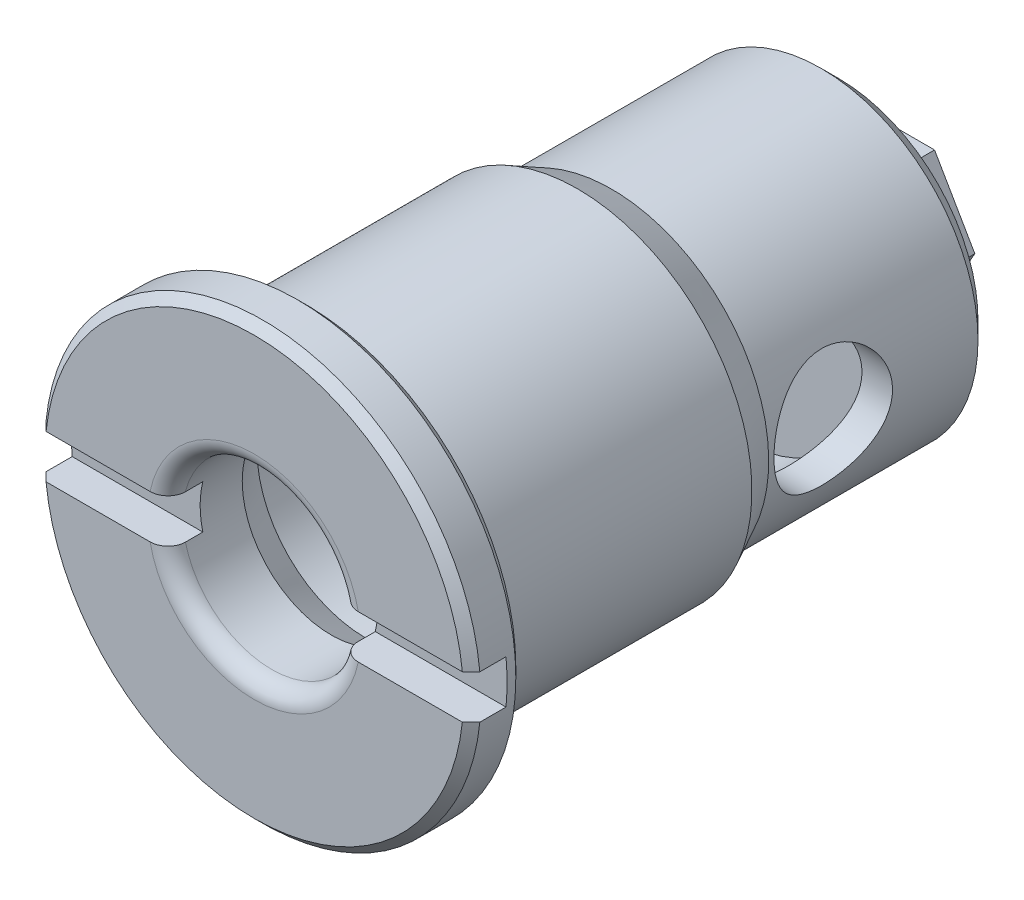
ISO-10303-21;
HEADER;
FILE_DESCRIPTION(('STEP AP214'),'2;1');
FILE_NAME('part.step','',(''),(''),'','','');
FILE_SCHEMA(('AUTOMOTIVE_DESIGN { 1 0 10303 214 1 1 1 1 }'));
ENDSEC;
DATA;
#1=APPLICATION_CONTEXT('core data for automotive mechanical design processes');
#2=APPLICATION_PROTOCOL_DEFINITION('international standard','automotive_design',2000,#1);
#3=PRODUCT_CONTEXT('',#1,'mechanical');
#4=PRODUCT('Part','Part','',(#3));
#5=PRODUCT_RELATED_PRODUCT_CATEGORY('part','',(#4));
#6=PRODUCT_DEFINITION_FORMATION('','',#4);
#7=PRODUCT_DEFINITION_CONTEXT('part definition',#1,'design');
#8=PRODUCT_DEFINITION('design','',#6,#7);
#9=PRODUCT_DEFINITION_SHAPE('','',#8);
#10=(LENGTH_UNIT() NAMED_UNIT(*) SI_UNIT(.MILLI.,.METRE.));
#11=(NAMED_UNIT(*) PLANE_ANGLE_UNIT() SI_UNIT($,.RADIAN.));
#12=(NAMED_UNIT(*) SI_UNIT($,.STERADIAN.) SOLID_ANGLE_UNIT());
#13=UNCERTAINTY_MEASURE_WITH_UNIT(LENGTH_MEASURE(1.E-05),#10,'distance_accuracy_value','');
#14=(GEOMETRIC_REPRESENTATION_CONTEXT(3) GLOBAL_UNCERTAINTY_ASSIGNED_CONTEXT((#13)) GLOBAL_UNIT_ASSIGNED_CONTEXT((#10,
#11,#12)) REPRESENTATION_CONTEXT('',''));
#15=CARTESIAN_POINT('',(0.,0.,0.));
#16=DIRECTION('',(0.,0.,1.));
#17=DIRECTION('',(1.,0.,0.));
#18=AXIS2_PLACEMENT_3D('',#15,#16,#17);
#19=CARTESIAN_POINT('',(0.,0.,-33.7));
#20=DIRECTION('',(0.,0.,1.));
#21=DIRECTION('',(0.,1.,0.));
#22=AXIS2_PLACEMENT_3D('',#19,#20,#21);
#23=PLANE('',#22);
#24=CARTESIAN_POINT('',(0.,0.,-33.7));
#25=DIRECTION('',(0.,0.,-1.));
#26=DIRECTION('',(-1.,0.,0.));
#27=AXIS2_PLACEMENT_3D('',#24,#25,#26);
#28=CIRCLE('',#27,3.);
#29=CARTESIAN_POINT('',(-3.,0.,-33.7));
#30=VERTEX_POINT('',#29);
#31=EDGE_CURVE('E899',#30,#30,#28,.T.);
#32=ORIENTED_EDGE('',*,*,#31,.F.);
#33=EDGE_LOOP('',(#32));
#34=FACE_BOUND('',#33,.T.);
#35=DIRECTION('',(-0.5,-0.866025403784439,0.));
#36=VECTOR('',#35,1.);
#37=CARTESIAN_POINT('',(-2.30940107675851,4.,-33.7));
#38=LINE('',#37,#36);
#39=CARTESIAN_POINT('',(-2.30940107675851,4.,-33.7));
#40=VERTEX_POINT('',#39);
#41=CARTESIAN_POINT('',(-4.61880215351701,0.,-33.7));
#42=VERTEX_POINT('',#41);
#43=EDGE_CURVE('E378',#40,#42,#38,.T.);
#44=ORIENTED_EDGE('',*,*,#43,.F.);
#45=DIRECTION('',(-1.,0.,0.));
#46=VECTOR('',#45,1.);
#47=CARTESIAN_POINT('',(2.30940107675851,4.,-33.7));
#48=LINE('',#47,#46);
#49=CARTESIAN_POINT('',(2.30940107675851,4.,-33.7));
#50=VERTEX_POINT('',#49);
#51=EDGE_CURVE('E903',#50,#40,#48,.T.);
#52=ORIENTED_EDGE('',*,*,#51,.F.);
#53=DIRECTION('',(-0.5,0.866025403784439,0.));
#54=VECTOR('',#53,1.);
#55=CARTESIAN_POINT('',(4.61880215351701,0.,-33.7));
#56=LINE('',#55,#54);
#57=CARTESIAN_POINT('',(4.61880215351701,0.,-33.7));
#58=VERTEX_POINT('',#57);
#59=EDGE_CURVE('E938',#58,#50,#56,.T.);
#60=ORIENTED_EDGE('',*,*,#59,.F.);
#61=DIRECTION('',(0.5,0.866025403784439,0.));
#62=VECTOR('',#61,1.);
#63=CARTESIAN_POINT('',(2.30940107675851,-4.,-33.7));
#64=LINE('',#63,#62);
#65=CARTESIAN_POINT('',(2.30940107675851,-4.,-33.7));
#66=VERTEX_POINT('',#65);
#67=EDGE_CURVE('E950',#66,#58,#64,.T.);
#68=ORIENTED_EDGE('',*,*,#67,.F.);
#69=DIRECTION('',(1.,0.,0.));
#70=VECTOR('',#69,1.);
#71=CARTESIAN_POINT('',(-2.30940107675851,-4.,-33.7));
#72=LINE('',#71,#70);
#73=CARTESIAN_POINT('',(-2.30940107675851,-4.,-33.7));
#74=VERTEX_POINT('',#73);
#75=EDGE_CURVE('E948',#74,#66,#72,.T.);
#76=ORIENTED_EDGE('',*,*,#75,.F.);
#77=DIRECTION('',(0.5,-0.866025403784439,0.));
#78=VECTOR('',#77,1.);
#79=CARTESIAN_POINT('',(-4.61880215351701,0.,-33.7));
#80=LINE('',#79,#78);
#81=EDGE_CURVE('E382',#42,#74,#80,.T.);
#82=ORIENTED_EDGE('',*,*,#81,.F.);
#83=EDGE_LOOP('',(#44,#52,#60,#68,#76,#82));
#84=FACE_BOUND('',#83,.T.);
#85=ADVANCED_FACE('F15',(#34,#84),#23,.F.);
#86=CARTESIAN_POINT('',(-2.30940107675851,4.,-30.5));
#87=DIRECTION('',(0.866025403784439,-0.5,0.));
#88=DIRECTION('',(0.5,0.866025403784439,0.));
#89=AXIS2_PLACEMENT_3D('',#86,#87,#88);
#90=PLANE('',#89);
#91=ORIENTED_EDGE('',*,*,#43,.T.);
#92=DIRECTION('',(0.,0.,-1.));
#93=VECTOR('',#92,1.);
#94=CARTESIAN_POINT('',(-4.61880215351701,0.,-30.5));
#95=LINE('',#94,#93);
#96=CARTESIAN_POINT('',(-4.61880215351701,0.,-30.5));
#97=VERTEX_POINT('',#96);
#98=EDGE_CURVE('E25',#97,#42,#95,.T.);
#99=ORIENTED_EDGE('',*,*,#98,.F.);
#100=DIRECTION('',(-0.5,-0.866025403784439,0.));
#101=VECTOR('',#100,1.);
#102=CARTESIAN_POINT('',(-2.30940107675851,4.,-30.5));
#103=LINE('',#102,#101);
#104=CARTESIAN_POINT('',(-2.30940107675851,4.,-30.5));
#105=VERTEX_POINT('',#104);
#106=EDGE_CURVE('E910',#105,#97,#103,.T.);
#107=ORIENTED_EDGE('',*,*,#106,.F.);
#108=DIRECTION('',(0.,0.,-1.));
#109=VECTOR('',#108,1.);
#110=CARTESIAN_POINT('',(-2.30940107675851,4.,-30.5));
#111=LINE('',#110,#109);
#112=EDGE_CURVE('E909',#105,#40,#111,.T.);
#113=ORIENTED_EDGE('',*,*,#112,.T.);
#114=EDGE_LOOP('',(#91,#99,#107,#113));
#115=FACE_BOUND('',#114,.T.);
#116=ADVANCED_FACE('F471',(#115),#90,.F.);
#117=CARTESIAN_POINT('',(-4.61880215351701,0.,-30.5));
#118=DIRECTION('',(0.866025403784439,0.5,0.));
#119=DIRECTION('',(-0.5,0.866025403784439,0.));
#120=AXIS2_PLACEMENT_3D('',#117,#118,#119);
#121=PLANE('',#120);
#122=ORIENTED_EDGE('',*,*,#81,.T.);
#123=DIRECTION('',(0.,0.,-1.));
#124=VECTOR('',#123,1.);
#125=CARTESIAN_POINT('',(-2.30940107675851,-4.,-30.5));
#126=LINE('',#125,#124);
#127=CARTESIAN_POINT('',(-2.30940107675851,-4.,-30.5));
#128=VERTEX_POINT('',#127);
#129=EDGE_CURVE('E925',#128,#74,#126,.T.);
#130=ORIENTED_EDGE('',*,*,#129,.F.);
#131=DIRECTION('',(0.5,-0.866025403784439,0.));
#132=VECTOR('',#131,1.);
#133=CARTESIAN_POINT('',(-4.61880215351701,0.,-30.5));
#134=LINE('',#133,#132);
#135=EDGE_CURVE('E931',#97,#128,#134,.T.);
#136=ORIENTED_EDGE('',*,*,#135,.F.);
#137=ORIENTED_EDGE('',*,*,#98,.T.);
#138=EDGE_LOOP('',(#122,#130,#136,#137));
#139=FACE_BOUND('',#138,.T.);
#140=ADVANCED_FACE('F868',(#139),#121,.F.);
#141=CARTESIAN_POINT('',(-2.30940107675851,-4.,-30.5));
#142=DIRECTION('',(0.,1.,0.));
#143=DIRECTION('',(0.,0.,-1.));
#144=AXIS2_PLACEMENT_3D('',#141,#142,#143);
#145=PLANE('',#144);
#146=ORIENTED_EDGE('',*,*,#75,.T.);
#147=DIRECTION('',(0.,0.,-1.));
#148=VECTOR('',#147,1.);
#149=CARTESIAN_POINT('',(2.30940107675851,-4.,-30.5));
#150=LINE('',#149,#148);
#151=CARTESIAN_POINT('',(2.30940107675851,-4.,-30.5));
#152=VERTEX_POINT('',#151);
#153=EDGE_CURVE('E923',#152,#66,#150,.T.);
#154=ORIENTED_EDGE('',*,*,#153,.F.);
#155=DIRECTION('',(1.,0.,0.));
#156=VECTOR('',#155,1.);
#157=CARTESIAN_POINT('',(-2.30940107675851,-4.,-30.5));
#158=LINE('',#157,#156);
#159=EDGE_CURVE('E935',#128,#152,#158,.T.);
#160=ORIENTED_EDGE('',*,*,#159,.F.);
#161=ORIENTED_EDGE('',*,*,#129,.T.);
#162=EDGE_LOOP('',(#146,#154,#160,#161));
#163=FACE_BOUND('',#162,.T.);
#164=ADVANCED_FACE('F858',(#163),#145,.F.);
#165=CARTESIAN_POINT('',(2.30940107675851,-4.,-30.5));
#166=DIRECTION('',(-0.866025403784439,0.5,0.));
#167=DIRECTION('',(-0.5,-0.866025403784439,0.));
#168=AXIS2_PLACEMENT_3D('',#165,#166,#167);
#169=PLANE('',#168);
#170=ORIENTED_EDGE('',*,*,#67,.T.);
#171=DIRECTION('',(0.,0.,-1.));
#172=VECTOR('',#171,1.);
#173=CARTESIAN_POINT('',(4.61880215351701,0.,-30.5));
#174=LINE('',#173,#172);
#175=CARTESIAN_POINT('',(4.61880215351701,0.,-30.5));
#176=VERTEX_POINT('',#175);
#177=EDGE_CURVE('E914',#176,#58,#174,.T.);
#178=ORIENTED_EDGE('',*,*,#177,.F.);
#179=DIRECTION('',(0.5,0.866025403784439,0.));
#180=VECTOR('',#179,1.);
#181=CARTESIAN_POINT('',(2.30940107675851,-4.,-30.5));
#182=LINE('',#181,#180);
#183=EDGE_CURVE('E943',#152,#176,#182,.T.);
#184=ORIENTED_EDGE('',*,*,#183,.F.);
#185=ORIENTED_EDGE('',*,*,#153,.T.);
#186=EDGE_LOOP('',(#170,#178,#184,#185));
#187=FACE_BOUND('',#186,.T.);
#188=ADVANCED_FACE('F848',(#187),#169,.F.);
#189=CARTESIAN_POINT('',(4.61880215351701,0.,-30.5));
#190=DIRECTION('',(-0.866025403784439,-0.5,0.));
#191=DIRECTION('',(0.5,-0.866025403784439,0.));
#192=AXIS2_PLACEMENT_3D('',#189,#190,#191);
#193=PLANE('',#192);
#194=ORIENTED_EDGE('',*,*,#59,.T.);
#195=DIRECTION('',(0.,0.,-1.));
#196=VECTOR('',#195,1.);
#197=CARTESIAN_POINT('',(2.30940107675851,4.,-30.5));
#198=LINE('',#197,#196);
#199=CARTESIAN_POINT('',(2.30940107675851,4.,-30.5));
#200=VERTEX_POINT('',#199);
#201=EDGE_CURVE('E911',#200,#50,#198,.T.);
#202=ORIENTED_EDGE('',*,*,#201,.F.);
#203=DIRECTION('',(-0.5,0.866025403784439,0.));
#204=VECTOR('',#203,1.);
#205=CARTESIAN_POINT('',(4.61880215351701,0.,-30.5));
#206=LINE('',#205,#204);
#207=EDGE_CURVE('E916',#176,#200,#206,.T.);
#208=ORIENTED_EDGE('',*,*,#207,.F.);
#209=ORIENTED_EDGE('',*,*,#177,.T.);
#210=EDGE_LOOP('',(#194,#202,#208,#209));
#211=FACE_BOUND('',#210,.T.);
#212=ADVANCED_FACE('F346',(#211),#193,.F.);
#213=CARTESIAN_POINT('',(2.30940107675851,4.,-30.5));
#214=DIRECTION('',(0.,-1.,0.));
#215=DIRECTION('',(0.,0.,1.));
#216=AXIS2_PLACEMENT_3D('',#213,#214,#215);
#217=PLANE('',#216);
#218=ORIENTED_EDGE('',*,*,#51,.T.);
#219=ORIENTED_EDGE('',*,*,#112,.F.);
#220=DIRECTION('',(-1.,0.,0.));
#221=VECTOR('',#220,1.);
#222=CARTESIAN_POINT('',(2.30940107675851,4.,-30.5));
#223=LINE('',#222,#221);
#224=EDGE_CURVE('E34',#200,#105,#223,.T.);
#225=ORIENTED_EDGE('',*,*,#224,.F.);
#226=ORIENTED_EDGE('',*,*,#201,.T.);
#227=EDGE_LOOP('',(#218,#219,#225,#226));
#228=FACE_BOUND('',#227,.T.);
#229=ADVANCED_FACE('F339',(#228),#217,.F.);
#230=CARTESIAN_POINT('',(0.,12.5,3.));
#231=DIRECTION('',(0.,0.,-1.));
#232=DIRECTION('',(-1.,0.,0.));
#233=AXIS2_PLACEMENT_3D('',#230,#231,#232);
#234=PLANE('',#233);
#235=DIRECTION('',(-1.,0.,0.));
#236=VECTOR('',#235,1.);
#237=CARTESIAN_POINT('',(13.,1.25,3.));
#238=LINE('',#237,#236);
#239=CARTESIAN_POINT('',(-5.97055273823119,1.25,3.));
#240=VERTEX_POINT('',#239);
#241=CARTESIAN_POINT('',(-11.93471826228,1.25,3.));
#242=VERTEX_POINT('',#241);
#243=EDGE_CURVE('E150',#240,#242,#238,.T.);
#244=ORIENTED_EDGE('',*,*,#243,.F.);
#245=CARTESIAN_POINT('',(0.,0.,3.));
#246=DIRECTION('',(0.,0.,-1.));
#247=DIRECTION('',(-1.,0.,0.));
#248=AXIS2_PLACEMENT_3D('',#245,#246,#247);
#249=CIRCLE('',#248,6.1);
#250=CARTESIAN_POINT('',(5.97055273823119,1.25,3.));
#251=VERTEX_POINT('',#250);
#252=EDGE_CURVE('E138',#240,#251,#249,.T.);
#253=ORIENTED_EDGE('',*,*,#252,.T.);
#254=CARTESIAN_POINT('',(11.93471826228,1.25,3.));
#255=VERTEX_POINT('',#254);
#256=EDGE_CURVE('E148',#255,#251,#238,.T.);
#257=ORIENTED_EDGE('',*,*,#256,.F.);
#258=CARTESIAN_POINT('',(0.,0.,3.));
#259=DIRECTION('',(0.,0.,-1.));
#260=DIRECTION('',(-1.,0.,0.));
#261=AXIS2_PLACEMENT_3D('',#258,#259,#260);
#262=CIRCLE('',#261,12.);
#263=EDGE_CURVE('E212',#255,#242,#262,.F.);
#264=ORIENTED_EDGE('',*,*,#263,.T.);
#265=EDGE_LOOP('',(#244,#253,#257,#264));
#266=FACE_BOUND('',#265,.T.);
#267=ADVANCED_FACE('F146',(#266),#234,.F.);
#268=DIRECTION('',(-1.,0.,0.));
#269=VECTOR('',#268,1.);
#270=CARTESIAN_POINT('',(13.,-1.25,3.));
#271=LINE('',#270,#269);
#272=CARTESIAN_POINT('',(11.93471826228,-1.25,3.));
#273=VERTEX_POINT('',#272);
#274=CARTESIAN_POINT('',(5.97055273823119,-1.25,3.));
#275=VERTEX_POINT('',#274);
#276=EDGE_CURVE('E168',#273,#275,#271,.T.);
#277=ORIENTED_EDGE('',*,*,#276,.T.);
#278=CARTESIAN_POINT('',(0.,0.,3.));
#279=DIRECTION('',(0.,0.,-1.));
#280=DIRECTION('',(-1.,0.,0.));
#281=AXIS2_PLACEMENT_3D('',#278,#279,#280);
#282=CIRCLE('',#281,6.1);
#283=CARTESIAN_POINT('',(-5.97055273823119,-1.25,3.));
#284=VERTEX_POINT('',#283);
#285=EDGE_CURVE('E405',#275,#284,#282,.T.);
#286=ORIENTED_EDGE('',*,*,#285,.T.);
#287=CARTESIAN_POINT('',(-11.93471826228,-1.25,3.));
#288=VERTEX_POINT('',#287);
#289=EDGE_CURVE('E389',#284,#288,#271,.T.);
#290=ORIENTED_EDGE('',*,*,#289,.T.);
#291=EDGE_CURVE('E213',#288,#273,#262,.F.);
#292=ORIENTED_EDGE('',*,*,#291,.T.);
#293=EDGE_LOOP('',(#277,#286,#290,#292));
#294=FACE_BOUND('',#293,.T.);
#295=ADVANCED_FACE('F261',(#294),#234,.F.);
#296=CARTESIAN_POINT('',(0.,0.,2.));
#297=DIRECTION('',(0.,0.,-1.));
#298=DIRECTION('',(-1.,0.,0.));
#299=AXIS2_PLACEMENT_3D('',#296,#297,#298);
#300=TOROIDAL_SURFACE('',#299,6.1,1.);
#301=CARTESIAN_POINT('',(-4.94444132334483,1.25,2.));
#302=CARTESIAN_POINT('',(-4.94444096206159,1.25,2.02754819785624));
#303=CARTESIAN_POINT('',(-4.94561626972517,1.25,2.05508293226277));
#304=CARTESIAN_POINT('',(-4.95030138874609,1.25,2.10994976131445));
#305=CARTESIAN_POINT('',(-4.95381091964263,1.25,2.13728187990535));
#306=CARTESIAN_POINT('',(-4.96779199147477,1.25,2.21858098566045));
#307=CARTESIAN_POINT('',(-4.98171621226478,1.25,2.27199431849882));
#308=CARTESIAN_POINT('',(-5.01830464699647,1.25,2.37570912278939));
#309=CARTESIAN_POINT('',(-5.040969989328,1.25,2.42601019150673));
#310=CARTESIAN_POINT('',(-5.09430542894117,1.25,2.52217878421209));
#311=CARTESIAN_POINT('',(-5.12497637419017,1.25,2.56804583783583));
#312=CARTESIAN_POINT('',(-5.19388247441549,1.25,2.65479020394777));
#313=CARTESIAN_POINT('',(-5.23222162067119,1.25,2.69558480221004));
#314=CARTESIAN_POINT('',(-5.31504537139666,1.25,2.77037900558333));
#315=CARTESIAN_POINT('',(-5.3595315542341,1.25,2.80437685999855));
#316=CARTESIAN_POINT('',(-5.45471183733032,1.25,2.86559289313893));
#317=CARTESIAN_POINT('',(-5.50554447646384,1.25,2.89259553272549));
#318=CARTESIAN_POINT('',(-5.61095213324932,1.25,2.93786742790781));
#319=CARTESIAN_POINT('',(-5.66552598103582,1.25,2.95613939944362));
#320=CARTESIAN_POINT('',(-5.76198712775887,1.25,2.97983537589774));
#321=CARTESIAN_POINT('',(-5.80336504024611,1.25,2.98738835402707));
#322=CARTESIAN_POINT('',(-5.88667440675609,1.25,2.99747112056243));
#323=CARTESIAN_POINT('',(-5.92860508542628,1.25,3.00000731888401));
#324=CARTESIAN_POINT('',(-5.97055273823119,1.25,3.));
#325=B_SPLINE_CURVE_WITH_KNOTS('',3,(#301,#302,#303,#304,#305,#306,#307,#308,#309,#310,#311,
#312,#313,#314,#315,#316,#317,#318,#319,#320,#321,#322,#323,#324),.UNSPECIFIED.,.F.,.F.,(4,2,2,
2,2,2,2,2,2,2,2,4),(0.,0.0825929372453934,0.165175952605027,0.329916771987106,0.494678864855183,
0.659458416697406,0.826646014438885,0.993876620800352,1.16577145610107,1.33761278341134,
1.46350802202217,1.58924230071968),.UNSPECIFIED.);
#326=CARTESIAN_POINT('',(-4.94444132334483,1.25,2.));
#327=VERTEX_POINT('',#326);
#328=EDGE_CURVE('E129',#327,#240,#325,.T.);
#329=ORIENTED_EDGE('',*,*,#328,.F.);
#330=CARTESIAN_POINT('',(0.,0.,2.));
#331=DIRECTION('',(0.,0.,-1.));
#332=DIRECTION('',(-1.,0.,0.));
#333=AXIS2_PLACEMENT_3D('',#330,#331,#332);
#334=CIRCLE('',#333,5.1);
#335=CARTESIAN_POINT('',(4.94444132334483,1.25,2.));
#336=VERTEX_POINT('',#335);
#337=EDGE_CURVE('E139',#336,#327,#334,.F.);
#338=ORIENTED_EDGE('',*,*,#337,.F.);
#339=CARTESIAN_POINT('',(5.97055273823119,1.25,3.));
#340=CARTESIAN_POINT('',(5.91184927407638,1.25,3.00004248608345));
#341=CARTESIAN_POINT('',(5.85315943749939,1.25,2.99505029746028));
#342=CARTESIAN_POINT('',(5.73745166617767,1.25,2.97534595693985));
#343=CARTESIAN_POINT('',(5.68043321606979,1.25,2.96063683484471));
#344=CARTESIAN_POINT('',(5.56964513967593,1.25,2.92183741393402));
#345=CARTESIAN_POINT('',(5.51587723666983,1.25,2.89774218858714));
#346=CARTESIAN_POINT('',(5.41319495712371,1.25,2.84081849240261));
#347=CARTESIAN_POINT('',(5.36427931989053,1.25,2.80799229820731));
#348=CARTESIAN_POINT('',(5.27307275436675,1.25,2.73470954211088));
#349=CARTESIAN_POINT('',(5.23073995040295,1.25,2.69430515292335));
#350=CARTESIAN_POINT('',(5.15364435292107,1.25,2.60680106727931));
#351=CARTESIAN_POINT('',(5.11888245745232,1.25,2.55970057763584));
#352=CARTESIAN_POINT('',(5.05881811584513,1.25,2.46130541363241));
#353=CARTESIAN_POINT('',(5.03331602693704,1.25,2.41013249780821));
#354=CARTESIAN_POINT('',(4.9915662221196,1.25,2.30416552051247));
#355=CARTESIAN_POINT('',(4.9753090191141,1.25,2.24937523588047));
#356=CARTESIAN_POINT('',(4.95747254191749,1.25,2.16176574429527));
#357=CARTESIAN_POINT('',(4.95258900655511,1.25,2.12958511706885));
#358=CARTESIAN_POINT('',(4.94607434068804,1.25,2.06494173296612));
#359=CARTESIAN_POINT('',(4.94443869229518,1.25,2.03247943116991));
#360=CARTESIAN_POINT('',(4.94444132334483,1.25,2.));
#361=B_SPLINE_CURVE_WITH_KNOTS('',3,(#339,#340,#341,#342,#343,#344,#345,#346,#347,#348,#349,
#350,#351,#352,#353,#354,#355,#356,#357,#358,#359,#360),.UNSPECIFIED.,.F.,.F.,(4,2,2,2,2,2,2,2,
2,2,4),(0.,0.175880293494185,0.35170577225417,0.527623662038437,0.703495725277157,
0.878198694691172,1.05292237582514,1.22361708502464,1.39413630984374,1.49163572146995,
1.5889994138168),.UNSPECIFIED.);
#362=EDGE_CURVE('E135',#251,#336,#361,.T.);
#363=ORIENTED_EDGE('',*,*,#362,.F.);
#364=ORIENTED_EDGE('',*,*,#252,.F.);
#365=EDGE_LOOP('',(#329,#338,#363,#364));
#366=FACE_BOUND('',#365,.T.);
#367=ADVANCED_FACE('F137',(#366),#300,.T.);
#368=CARTESIAN_POINT('',(0.,0.,2.));
#369=DIRECTION('',(0.,0.,-1.));
#370=DIRECTION('',(-1.,0.,0.));
#371=AXIS2_PLACEMENT_3D('',#368,#369,#370);
#372=TOROIDAL_SURFACE('',#371,6.1,1.);
#373=CARTESIAN_POINT('',(4.94444132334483,-1.25,2.));
#374=CARTESIAN_POINT('',(4.94444096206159,-1.25,2.02754819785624));
#375=CARTESIAN_POINT('',(4.94561626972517,-1.25,2.05508293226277));
#376=CARTESIAN_POINT('',(4.95030138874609,-1.25,2.10994976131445));
#377=CARTESIAN_POINT('',(4.95381091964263,-1.25,2.13728187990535));
#378=CARTESIAN_POINT('',(4.96779199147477,-1.25,2.21858098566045));
#379=CARTESIAN_POINT('',(4.98171621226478,-1.25,2.27199431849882));
#380=CARTESIAN_POINT('',(5.01830464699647,-1.25,2.37570912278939));
#381=CARTESIAN_POINT('',(5.040969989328,-1.25,2.42601019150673));
#382=CARTESIAN_POINT('',(5.09430542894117,-1.25,2.52217878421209));
#383=CARTESIAN_POINT('',(5.12497637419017,-1.25,2.56804583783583));
#384=CARTESIAN_POINT('',(5.19388247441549,-1.25,2.65479020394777));
#385=CARTESIAN_POINT('',(5.23222162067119,-1.25,2.69558480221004));
#386=CARTESIAN_POINT('',(5.31504537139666,-1.25,2.77037900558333));
#387=CARTESIAN_POINT('',(5.3595315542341,-1.25,2.80437685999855));
#388=CARTESIAN_POINT('',(5.45471183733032,-1.25,2.86559289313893));
#389=CARTESIAN_POINT('',(5.50554447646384,-1.25,2.89259553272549));
#390=CARTESIAN_POINT('',(5.61095213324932,-1.25,2.93786742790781));
#391=CARTESIAN_POINT('',(5.66552598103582,-1.25,2.95613939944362));
#392=CARTESIAN_POINT('',(5.76198712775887,-1.25,2.97983537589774));
#393=CARTESIAN_POINT('',(5.80336504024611,-1.25,2.98738835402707));
#394=CARTESIAN_POINT('',(5.88667440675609,-1.25,2.99747112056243));
#395=CARTESIAN_POINT('',(5.92860508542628,-1.25,3.00000731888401));
#396=CARTESIAN_POINT('',(5.97055273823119,-1.25,3.));
#397=B_SPLINE_CURVE_WITH_KNOTS('',3,(#373,#374,#375,#376,#377,#378,#379,#380,#381,#382,#383,
#384,#385,#386,#387,#388,#389,#390,#391,#392,#393,#394,#395,#396),.UNSPECIFIED.,.F.,.F.,(4,2,2,
2,2,2,2,2,2,2,2,4),(0.,0.0825929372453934,0.165175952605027,0.329916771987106,0.494678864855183,
0.659458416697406,0.826646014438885,0.993876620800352,1.16577145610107,1.33761278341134,
1.46350802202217,1.58924230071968),.UNSPECIFIED.);
#398=CARTESIAN_POINT('',(4.94444132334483,-1.25,2.));
#399=VERTEX_POINT('',#398);
#400=EDGE_CURVE('E151',#399,#275,#397,.T.);
#401=ORIENTED_EDGE('',*,*,#400,.F.);
#402=CARTESIAN_POINT('',(0.,0.,2.));
#403=DIRECTION('',(0.,0.,-1.));
#404=DIRECTION('',(-1.,0.,0.));
#405=AXIS2_PLACEMENT_3D('',#402,#403,#404);
#406=CIRCLE('',#405,5.1);
#407=CARTESIAN_POINT('',(-4.94444132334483,-1.25,2.));
#408=VERTEX_POINT('',#407);
#409=EDGE_CURVE('E430',#408,#399,#406,.F.);
#410=ORIENTED_EDGE('',*,*,#409,.F.);
#411=CARTESIAN_POINT('',(-5.97055273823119,-1.25,3.));
#412=CARTESIAN_POINT('',(-5.91184927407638,-1.25,3.00004248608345));
#413=CARTESIAN_POINT('',(-5.85315943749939,-1.25,2.99505029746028));
#414=CARTESIAN_POINT('',(-5.73745166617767,-1.25,2.97534595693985));
#415=CARTESIAN_POINT('',(-5.68043321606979,-1.25,2.96063683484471));
#416=CARTESIAN_POINT('',(-5.56964513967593,-1.25,2.92183741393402));
#417=CARTESIAN_POINT('',(-5.51587723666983,-1.25,2.89774218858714));
#418=CARTESIAN_POINT('',(-5.41319495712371,-1.25,2.84081849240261));
#419=CARTESIAN_POINT('',(-5.36427931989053,-1.25,2.80799229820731));
#420=CARTESIAN_POINT('',(-5.27307275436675,-1.25,2.73470954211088));
#421=CARTESIAN_POINT('',(-5.23073995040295,-1.25,2.69430515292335));
#422=CARTESIAN_POINT('',(-5.15364435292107,-1.25,2.60680106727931));
#423=CARTESIAN_POINT('',(-5.11888245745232,-1.25,2.55970057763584));
#424=CARTESIAN_POINT('',(-5.05881811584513,-1.25,2.46130541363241));
#425=CARTESIAN_POINT('',(-5.03331602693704,-1.25,2.41013249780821));
#426=CARTESIAN_POINT('',(-4.9915662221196,-1.25,2.30416552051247));
#427=CARTESIAN_POINT('',(-4.9753090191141,-1.25,2.24937523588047));
#428=CARTESIAN_POINT('',(-4.95747254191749,-1.25,2.16176574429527));
#429=CARTESIAN_POINT('',(-4.95258900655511,-1.25,2.12958511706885));
#430=CARTESIAN_POINT('',(-4.94607434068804,-1.25,2.06494173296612));
#431=CARTESIAN_POINT('',(-4.94443869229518,-1.25,2.03247943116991));
#432=CARTESIAN_POINT('',(-4.94444132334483,-1.25,2.));
#433=B_SPLINE_CURVE_WITH_KNOTS('',3,(#411,#412,#413,#414,#415,#416,#417,#418,#419,#420,#421,
#422,#423,#424,#425,#426,#427,#428,#429,#430,#431,#432),.UNSPECIFIED.,.F.,.F.,(4,2,2,2,2,2,2,2,
2,2,4),(0.,0.175880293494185,0.35170577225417,0.527623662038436,0.703495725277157,
0.878198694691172,1.05292237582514,1.22361708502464,1.39413630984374,1.49163572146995,
1.5889994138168),.UNSPECIFIED.);
#434=EDGE_CURVE('E408',#284,#408,#433,.T.);
#435=ORIENTED_EDGE('',*,*,#434,.F.);
#436=ORIENTED_EDGE('',*,*,#285,.F.);
#437=EDGE_LOOP('',(#401,#410,#435,#436));
#438=FACE_BOUND('',#437,.T.);
#439=ADVANCED_FACE('F239',(#438),#372,.T.);
#440=CARTESIAN_POINT('',(13.,1.25,3.));
#441=DIRECTION('',(0.,1.,0.));
#442=DIRECTION('',(0.,0.,-1.));
#443=AXIS2_PLACEMENT_3D('',#440,#441,#442);
#444=PLANE('',#443);
#445=ORIENTED_EDGE('',*,*,#256,.T.);
#446=ORIENTED_EDGE('',*,*,#362,.T.);
#447=DIRECTION('',(0.,0.,-1.));
#448=VECTOR('',#447,1.);
#449=CARTESIAN_POINT('',(4.94444132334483,1.25,-17.5262382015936));
#450=LINE('',#449,#448);
#451=CARTESIAN_POINT('',(4.94444132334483,1.25,1.));
#452=VERTEX_POINT('',#451);
#453=EDGE_CURVE('E173',#452,#336,#450,.F.);
#454=ORIENTED_EDGE('',*,*,#453,.F.);
#455=DIRECTION('',(-1.,0.,0.));
#456=VECTOR('',#455,1.);
#457=CARTESIAN_POINT('',(13.,1.25,1.));
#458=LINE('',#457,#456);
#459=CARTESIAN_POINT('',(12.4373429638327,1.25,1.));
#460=VERTEX_POINT('',#459);
#461=EDGE_CURVE('E159',#460,#452,#458,.T.);
#462=ORIENTED_EDGE('',*,*,#461,.F.);
#463=DIRECTION('',(0.,0.,-1.));
#464=VECTOR('',#463,1.);
#465=CARTESIAN_POINT('',(12.4373429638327,1.25,-17.5262382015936));
#466=LINE('',#465,#464);
#467=CARTESIAN_POINT('',(12.4373429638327,1.25,2.5));
#468=VERTEX_POINT('',#467);
#469=EDGE_CURVE('E167',#468,#460,#466,.T.);
#470=ORIENTED_EDGE('',*,*,#469,.F.);
#471=CARTESIAN_POINT('',(27.4747792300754,1.25,-12.50319970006));
#472=CARTESIAN_POINT('',(26.5271528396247,1.25,-11.5565603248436));
#473=CARTESIAN_POINT('',(25.5794832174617,1.24999999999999,-10.6099642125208));
#474=CARTESIAN_POINT('',(23.6839973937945,1.24999999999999,-8.71691002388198));
#475=CARTESIAN_POINT('',(22.7361811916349,1.25,-7.77045194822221));
#476=CARTESIAN_POINT('',(20.8402512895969,1.25,-5.87763469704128));
#477=CARTESIAN_POINT('',(19.8921375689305,1.25,-4.93127554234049));
#478=CARTESIAN_POINT('',(17.9956117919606,1.25,-3.03886472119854));
#479=CARTESIAN_POINT('',(17.0471997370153,1.25,-2.09281305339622));
#480=CARTESIAN_POINT('',(15.1455605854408,1.25,-0.196872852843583));
#481=CARTESIAN_POINT('',(14.1923312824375,1.25,0.753013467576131));
#482=CARTESIAN_POINT('',(12.7618194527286,1.25,2.17718541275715));
#483=CARTESIAN_POINT('',(12.2848675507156,1.25,2.65180309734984));
#484=CARTESIAN_POINT('',(11.3306490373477,1.25,3.60072074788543));
#485=CARTESIAN_POINT('',(10.853382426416,1.25,4.07502071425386));
#486=CARTESIAN_POINT('',(9.89842185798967,1.25,5.02312814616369));
#487=CARTESIAN_POINT('',(9.42072793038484,1.25,5.496935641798));
#488=CARTESIAN_POINT('',(8.46462454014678,1.25,6.4438331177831));
#489=CARTESIAN_POINT('',(7.98621507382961,1.25,6.91692309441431));
#490=CARTESIAN_POINT('',(7.02824115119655,1.25,7.86191086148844));
#491=CARTESIAN_POINT('',(6.5486767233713,1.25,8.33380868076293));
#492=CARTESIAN_POINT('',(5.82767655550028,1.25,9.03996375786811));
#493=CARTESIAN_POINT('',(5.58706857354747,1.25,9.27506587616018));
#494=CARTESIAN_POINT('',(5.1050438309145,1.25,9.74443925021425));
#495=CARTESIAN_POINT('',(4.86362707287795,1.25,9.9787105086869));
#496=CARTESIAN_POINT('',(4.5555514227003,1.25,10.276097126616));
#497=CARTESIAN_POINT('',(4.48946169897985,1.25,10.3398021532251));
#498=CARTESIAN_POINT('',(4.3571764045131,1.25,10.4671022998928));
#499=CARTESIAN_POINT('',(4.29098083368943,1.25,10.5306974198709));
#500=CARTESIAN_POINT('',(4.09221441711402,1.25,10.7212968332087));
#501=CARTESIAN_POINT('',(3.95946448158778,1.25,10.8481145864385));
#502=CARTESIAN_POINT('',(3.69337156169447,1.25,11.1010531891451));
#503=CARTESIAN_POINT('',(3.56002875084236,1.25000000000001,11.2271742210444));
#504=CARTESIAN_POINT('',(3.29249247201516,1.25,11.4785096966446));
#505=CARTESIAN_POINT('',(3.15829901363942,1.25,11.603724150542));
#506=CARTESIAN_POINT('',(2.93325554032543,1.25,11.8116923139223));
#507=CARTESIAN_POINT('',(2.84273647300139,1.25,11.8948038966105));
#508=CARTESIAN_POINT('',(2.66100588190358,1.25000000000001,12.0602660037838));
#509=CARTESIAN_POINT('',(2.56979436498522,1.25,12.1426165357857));
#510=CARTESIAN_POINT('',(2.38641533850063,1.25,12.3063462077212));
#511=CARTESIAN_POINT('',(2.29424734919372,1.25000000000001,12.3877248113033));
#512=CARTESIAN_POINT('',(2.10869882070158,1.25,12.5490810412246));
#513=CARTESIAN_POINT('',(2.01531836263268,1.25,12.6290587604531));
#514=CARTESIAN_POINT('',(1.84623337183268,1.25,12.7707816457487));
#515=CARTESIAN_POINT('',(1.77083949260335,1.25,12.8328964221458));
#516=CARTESIAN_POINT('',(1.61864816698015,1.25000000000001,12.9553786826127));
#517=CARTESIAN_POINT('',(1.54185083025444,1.25,13.0157463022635));
#518=CARTESIAN_POINT('',(1.38635041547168,1.25,13.1340118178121));
#519=CARTESIAN_POINT('',(1.30764712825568,1.25000000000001,13.1919094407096));
#520=CARTESIAN_POINT('',(1.14767117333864,1.25,13.3040089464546));
#521=CARTESIAN_POINT('',(1.06639967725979,1.25,13.3582124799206));
#522=CARTESIAN_POINT('',(0.89781389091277,1.25,13.4624589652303));
#523=CARTESIAN_POINT('',(0.810391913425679,1.25000000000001,13.5123311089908));
#524=CARTESIAN_POINT('',(0.630507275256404,1.25,13.6021549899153));
#525=CARTESIAN_POINT('',(0.538051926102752,1.25,13.6421206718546));
#526=CARTESIAN_POINT('',(0.369926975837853,1.25,13.6981926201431));
#527=CARTESIAN_POINT('',(0.295455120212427,1.25,13.7177055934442));
#528=CARTESIAN_POINT('',(0.182187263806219,1.25000000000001,13.7373434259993));
#529=CARTESIAN_POINT('',(0.144212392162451,1.25000000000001,13.7422839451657));
#530=CARTESIAN_POINT('',(0.0679652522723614,1.25,13.7487283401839));
#531=CARTESIAN_POINT('',(0.0296930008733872,1.25,13.7502324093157));
#532=CARTESIAN_POINT('',(-0.0469397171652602,1.25,13.7497081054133));
#533=CARTESIAN_POINT('',(-0.0853001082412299,1.25,13.7476692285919));
#534=CARTESIAN_POINT('',(-0.161684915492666,1.25000000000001,13.7401600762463));
#535=CARTESIAN_POINT('',(-0.19970926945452,1.25000000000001,13.7346891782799));
#536=CARTESIAN_POINT('',(-0.275250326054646,1.25000000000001,13.7205934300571));
#537=CARTESIAN_POINT('',(-0.312765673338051,1.25000000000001,13.7119614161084));
#538=CARTESIAN_POINT('',(-0.387043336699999,1.25,13.6919390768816));
#539=CARTESIAN_POINT('',(-0.423805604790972,1.25,13.6805485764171));
#540=CARTESIAN_POINT('',(-0.540857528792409,1.25,13.6401172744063));
#541=CARTESIAN_POINT('',(-0.619563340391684,1.25,13.6064902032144));
#542=CARTESIAN_POINT('',(-0.773309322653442,1.25000000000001,13.5316757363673));
#543=CARTESIAN_POINT('',(-0.848341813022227,1.25000000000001,13.4904732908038));
#544=CARTESIAN_POINT('',(-0.996063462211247,1.25,13.4027871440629));
#545=CARTESIAN_POINT('',(-1.06872796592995,1.25,13.356262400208));
#546=CARTESIAN_POINT('',(-1.17596652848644,1.25000000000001,13.2839847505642));
#547=CARTESIAN_POINT('',(-1.21140446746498,1.25000000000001,13.2594884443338));
#548=CARTESIAN_POINT('',(-1.28178255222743,1.25,13.2097918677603));
#549=CARTESIAN_POINT('',(-1.31672271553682,1.25,13.1845916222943));
#550=CARTESIAN_POINT('',(-1.42765008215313,1.25,13.1031614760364));
#551=CARTESIAN_POINT('',(-1.50281998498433,1.25,13.045819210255));
#552=CARTESIAN_POINT('',(-1.65163611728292,1.25000000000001,12.9291847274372));
#553=CARTESIAN_POINT('',(-1.72528211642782,1.25000000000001,12.8698922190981));
#554=CARTESIAN_POINT('',(-1.87144784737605,1.25,12.7498718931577));
#555=CARTESIAN_POINT('',(-1.94396705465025,1.25,12.6891434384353));
#556=CARTESIAN_POINT('',(-2.08811148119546,1.25000000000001,12.5666329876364));
#557=CARTESIAN_POINT('',(-2.15973666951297,1.25,12.5048509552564));
#558=CARTESIAN_POINT('',(-2.37381026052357,1.25,12.3181051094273));
#559=CARTESIAN_POINT('',(-2.51521335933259,1.25,12.1919444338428));
#560=CARTESIAN_POINT('',(-2.79619761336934,1.25,11.9376989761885));
#561=CARTESIAN_POINT('',(-2.93577925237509,1.25,11.809614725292));
#562=CARTESIAN_POINT('',(-3.21321182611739,1.25,11.5526076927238));
#563=CARTESIAN_POINT('',(-3.35106724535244,1.25,11.4236897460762));
#564=CARTESIAN_POINT('',(-3.6259293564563,1.25,11.1649351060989));
#565=CARTESIAN_POINT('',(-3.76293598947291,1.25,11.03509835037));
#566=CARTESIAN_POINT('',(-4.0361799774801,1.25,10.7748949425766));
#567=CARTESIAN_POINT('',(-4.17241797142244,1.25000000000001,10.6445289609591));
#568=CARTESIAN_POINT('',(-4.44441372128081,1.25,10.3833036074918));
#569=CARTESIAN_POINT('',(-4.5801714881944,1.25,10.2524442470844));
#570=CARTESIAN_POINT('',(-4.98584468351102,1.25,9.86031988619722));
#571=CARTESIAN_POINT('',(-5.25521952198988,1.25,9.59849578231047));
#572=CARTESIAN_POINT('',(-5.79305552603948,1.25000000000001,9.07391040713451));
#573=CARTESIAN_POINT('',(-6.06151668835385,1.25,8.81114913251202));
#574=CARTESIAN_POINT('',(-6.86600033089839,1.25,8.02192995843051));
#575=CARTESIAN_POINT('',(-7.40111368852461,1.25,7.49454572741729));
#576=CARTESIAN_POINT('',(-8.47032718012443,1.25,6.43832523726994));
#577=CARTESIAN_POINT('',(-9.00442682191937,1.25,5.90948848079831));
#578=CARTESIAN_POINT('',(-10.0718876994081,1.25,4.85107868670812));
#579=CARTESIAN_POINT('',(-10.6052489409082,1.25,4.32150565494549));
#580=CARTESIAN_POINT('',(-11.6717181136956,1.25,3.26168678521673));
#581=CARTESIAN_POINT('',(-12.2048258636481,1.25,2.73144076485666));
#582=CARTESIAN_POINT('',(-13.2707285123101,1.25,1.67063215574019));
#583=CARTESIAN_POINT('',(-13.8035234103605,1.25,1.14006956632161));
#584=CARTESIAN_POINT('',(-15.4014599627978,1.25,-0.451821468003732));
#585=CARTESIAN_POINT('',(-16.4662768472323,1.25,-1.51347588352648));
#586=CARTESIAN_POINT('',(-18.3600687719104,1.25,-3.40248030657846));
#587=CARTESIAN_POINT('',(-19.1891363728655,1.25,-4.22973754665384));
#588=CARTESIAN_POINT('',(-20.8471024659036,1.25,-5.88447963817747));
#589=CARTESIAN_POINT('',(-21.676000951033,1.25,-6.71196449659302));
#590=CARTESIAN_POINT('',(-23.3332848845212,1.25,-8.36669798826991));
#591=CARTESIAN_POINT('',(-24.161670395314,1.25,-9.19394655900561));
#592=CARTESIAN_POINT('',(-25.8183085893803,1.25,-10.8485184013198));
#593=CARTESIAN_POINT('',(-26.646561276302,1.25,-11.6758416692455));
#594=CARTESIAN_POINT('',(-27.4747792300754,1.25,-12.50319970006));
#595=B_SPLINE_CURVE_WITH_KNOTS('',3,(#471,#472,#473,#474,#475,#476,#477,#478,#479,#480,#481,
#482,#483,#484,#485,#486,#487,#488,#489,#490,#491,#492,#493,#494,#495,#496,#497,#498,#499,#500,
#501,#502,#503,#504,#505,#506,#507,#508,#509,#510,#511,#512,#513,#514,#515,#516,#517,#518,#519,
#520,#521,#522,#523,#524,#525,#526,#527,#528,#529,#530,#531,#532,#533,#534,#535,#536,#537,#538,
#539,#540,#541,#542,#543,#544,#545,#546,#547,#548,#549,#550,#551,#552,#553,#554,#555,#556,#557,
#558,#559,#560,#561,#562,#563,#564,#565,#566,#567,#568,#569,#570,#571,#572,#573,#574,#575,#576,
#577,#578,#579,#580,#581,#582,#583,#584,#585,#586,#587,#588,#589,#590,#591,#592,#593,#594),
.UNSPECIFIED.,.F.,.F.,(4,2,2,2,2,2,2,2,2,2,2,2,2,2,2,2,2,2,2,2,2,2,2,2,2,2,2,2,2,2,2,2,2,2,2,2,
2,2,2,2,2,2,2,2,2,2,2,2,2,2,2,2,2,2,2,2,2,2,2,2,2,4),(0.,4.01834506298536,8.03670864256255,
12.0554941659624,16.0742616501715,20.1113853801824,22.1299752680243,24.148562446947,
26.1670180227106,28.1854840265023,30.2039007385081,31.2131007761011,32.2222975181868,
32.4976801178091,32.7730629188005,33.3238310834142,33.8744474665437,34.4250576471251,
34.7937158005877,35.1623703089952,35.5312196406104,35.900044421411,36.1930832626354,
36.4860993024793,36.7791476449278,37.0720641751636,37.3736575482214,37.6748239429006,
37.9048054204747,38.0195530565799,38.1342942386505,38.2493761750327,38.3644789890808,
38.4798442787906,38.5952168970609,38.8512698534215,39.1078371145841,39.3665364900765,
39.4957724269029,39.6250038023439,39.9085847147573,40.1922081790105,40.4759599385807,
40.7597214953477,41.328194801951,41.8965139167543,42.462736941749,43.028998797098,
43.5946867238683,44.1603616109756,45.2873142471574,46.4142708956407,48.6682230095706,
50.9230786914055,53.1779165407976,55.4336385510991,57.6893652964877,62.2002967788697,
65.713894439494,69.2276153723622,72.7397464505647,76.2517539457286),.UNSPECIFIED.);
#596=EDGE_CURVE('E155',#468,#255,#595,.T.);
#597=ORIENTED_EDGE('',*,*,#596,.T.);
#598=EDGE_LOOP('',(#445,#446,#454,#462,#470,#597));
#599=FACE_BOUND('',#598,.T.);
#600=ADVANCED_FACE('F153',(#599),#444,.F.);
#601=CARTESIAN_POINT('',(0.,0.,2.5));
#602=DIRECTION('',(0.,0.,-1.));
#603=DIRECTION('',(-1.,0.,0.));
#604=AXIS2_PLACEMENT_3D('',#601,#602,#603);
#605=CONICAL_SURFACE('',#604,12.5,0.78539816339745);
#606=ORIENTED_EDGE('',*,*,#596,.F.);
#607=CARTESIAN_POINT('',(0.,0.,2.5));
#608=DIRECTION('',(0.,0.,-1.));
#609=DIRECTION('',(-1.,0.,0.));
#610=AXIS2_PLACEMENT_3D('',#607,#608,#609);
#611=CIRCLE('',#610,12.5);
#612=CARTESIAN_POINT('',(-12.4373429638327,1.25,2.5));
#613=VERTEX_POINT('',#612);
#614=EDGE_CURVE('E206',#613,#468,#611,.T.);
#615=ORIENTED_EDGE('',*,*,#614,.F.);
#616=EDGE_CURVE('E216',#242,#613,#595,.T.);
#617=ORIENTED_EDGE('',*,*,#616,.F.);
#618=ORIENTED_EDGE('',*,*,#263,.F.);
#619=EDGE_LOOP('',(#606,#615,#617,#618));
#620=FACE_BOUND('',#619,.T.);
#621=ADVANCED_FACE('F231',(#620),#605,.T.);
#622=DIRECTION('',(0.,0.,-1.));
#623=VECTOR('',#622,1.);
#624=CARTESIAN_POINT('',(-4.94444132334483,1.25,-17.5262382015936));
#625=LINE('',#624,#623);
#626=CARTESIAN_POINT('',(-4.94444132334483,1.25,1.));
#627=VERTEX_POINT('',#626);
#628=EDGE_CURVE('E171',#327,#627,#625,.T.);
#629=ORIENTED_EDGE('',*,*,#628,.F.);
#630=ORIENTED_EDGE('',*,*,#328,.T.);
#631=ORIENTED_EDGE('',*,*,#243,.T.);
#632=ORIENTED_EDGE('',*,*,#616,.T.);
#633=DIRECTION('',(0.,0.,-1.));
#634=VECTOR('',#633,1.);
#635=CARTESIAN_POINT('',(-12.4373429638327,1.25,-17.5262382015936));
#636=LINE('',#635,#634);
#637=CARTESIAN_POINT('',(-12.4373429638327,1.25,1.));
#638=VERTEX_POINT('',#637);
#639=EDGE_CURVE('E164',#638,#613,#636,.F.);
#640=ORIENTED_EDGE('',*,*,#639,.F.);
#641=EDGE_CURVE('E156',#627,#638,#458,.T.);
#642=ORIENTED_EDGE('',*,*,#641,.F.);
#643=EDGE_LOOP('',(#629,#630,#631,#632,#640,#642));
#644=FACE_BOUND('',#643,.T.);
#645=ADVANCED_FACE('F240',(#644),#444,.F.);
#646=CARTESIAN_POINT('',(13.,1.25,1.));
#647=DIRECTION('',(0.,0.,-1.));
#648=DIRECTION('',(0.,-1.,0.));
#649=AXIS2_PLACEMENT_3D('',#646,#647,#648);
#650=PLANE('',#649);
#651=DIRECTION('',(-1.,0.,0.));
#652=VECTOR('',#651,1.);
#653=CARTESIAN_POINT('',(13.,-1.25,1.));
#654=LINE('',#653,#652);
#655=CARTESIAN_POINT('',(-4.94444132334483,-1.25,1.));
#656=VERTEX_POINT('',#655);
#657=CARTESIAN_POINT('',(-12.4373429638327,-1.25,1.));
#658=VERTEX_POINT('',#657);
#659=EDGE_CURVE('E391',#656,#658,#654,.T.);
#660=ORIENTED_EDGE('',*,*,#659,.F.);
#661=CARTESIAN_POINT('',(0.,0.,1.));
#662=DIRECTION('',(0.,0.,-1.));
#663=DIRECTION('',(0.,-1.,0.));
#664=AXIS2_PLACEMENT_3D('',#661,#662,#663);
#665=CIRCLE('',#664,5.1);
#666=EDGE_CURVE('E406',#627,#656,#665,.F.);
#667=ORIENTED_EDGE('',*,*,#666,.F.);
#668=ORIENTED_EDGE('',*,*,#641,.T.);
#669=CARTESIAN_POINT('',(0.,0.,1.));
#670=DIRECTION('',(0.,0.,-1.));
#671=DIRECTION('',(0.,-1.,0.));
#672=AXIS2_PLACEMENT_3D('',#669,#670,#671);
#673=CIRCLE('',#672,12.5);
#674=EDGE_CURVE('E189',#658,#638,#673,.T.);
#675=ORIENTED_EDGE('',*,*,#674,.F.);
#676=EDGE_LOOP('',(#660,#667,#668,#675));
#677=FACE_BOUND('',#676,.T.);
#678=ADVANCED_FACE('F242',(#677),#650,.F.);
#679=CARTESIAN_POINT('',(13.,-1.25,3.));
#680=DIRECTION('',(0.,-1.,0.));
#681=DIRECTION('',(0.,0.,1.));
#682=AXIS2_PLACEMENT_3D('',#679,#680,#681);
#683=PLANE('',#682);
#684=ORIENTED_EDGE('',*,*,#289,.F.);
#685=ORIENTED_EDGE('',*,*,#434,.T.);
#686=DIRECTION('',(0.,0.,-1.));
#687=VECTOR('',#686,1.);
#688=CARTESIAN_POINT('',(-4.94444132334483,-1.25,-17.5262382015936));
#689=LINE('',#688,#687);
#690=EDGE_CURVE('E183',#656,#408,#689,.F.);
#691=ORIENTED_EDGE('',*,*,#690,.F.);
#692=ORIENTED_EDGE('',*,*,#659,.T.);
#693=DIRECTION('',(0.,0.,-1.));
#694=VECTOR('',#693,1.);
#695=CARTESIAN_POINT('',(-12.4373429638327,-1.25,-17.5262382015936));
#696=LINE('',#695,#694);
#697=CARTESIAN_POINT('',(-12.4373429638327,-1.25,2.5));
#698=VERTEX_POINT('',#697);
#699=EDGE_CURVE('E178',#698,#658,#696,.T.);
#700=ORIENTED_EDGE('',*,*,#699,.F.);
#701=CARTESIAN_POINT('',(-27.4747792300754,-1.25,-12.50319970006));
#702=CARTESIAN_POINT('',(-26.5271528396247,-1.25,-11.5565603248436));
#703=CARTESIAN_POINT('',(-25.5794832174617,-1.25,-10.6099642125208));
#704=CARTESIAN_POINT('',(-23.6839973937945,-1.25,-8.71691002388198));
#705=CARTESIAN_POINT('',(-22.7361811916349,-1.25,-7.77045194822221));
#706=CARTESIAN_POINT('',(-20.8402512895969,-1.25,-5.87763469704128));
#707=CARTESIAN_POINT('',(-19.8921375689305,-1.25,-4.93127554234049));
#708=CARTESIAN_POINT('',(-17.9956117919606,-1.25,-3.03886472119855));
#709=CARTESIAN_POINT('',(-17.0471997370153,-1.25,-2.09281305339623));
#710=CARTESIAN_POINT('',(-15.1455605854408,-1.25,-0.196872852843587));
#711=CARTESIAN_POINT('',(-14.1923312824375,-1.25,0.753013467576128));
#712=CARTESIAN_POINT('',(-12.7618194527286,-1.25,2.17718541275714));
#713=CARTESIAN_POINT('',(-12.2848675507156,-1.25,2.65180309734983));
#714=CARTESIAN_POINT('',(-11.3306490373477,-1.25,3.60072074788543));
#715=CARTESIAN_POINT('',(-10.853382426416,-1.25,4.07502071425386));
#716=CARTESIAN_POINT('',(-9.89842185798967,-1.25,5.02312814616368));
#717=CARTESIAN_POINT('',(-9.42072793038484,-1.25,5.496935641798));
#718=CARTESIAN_POINT('',(-8.46462454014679,-1.25,6.4438331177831));
#719=CARTESIAN_POINT('',(-7.98621507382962,-1.25,6.91692309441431));
#720=CARTESIAN_POINT('',(-7.02824115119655,-1.25,7.86191086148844));
#721=CARTESIAN_POINT('',(-6.5486767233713,-1.25,8.33380868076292));
#722=CARTESIAN_POINT('',(-5.82767655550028,-1.25,9.03996375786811));
#723=CARTESIAN_POINT('',(-5.58706857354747,-1.25,9.27506587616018));
#724=CARTESIAN_POINT('',(-5.1050438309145,-1.25,9.74443925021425));
#725=CARTESIAN_POINT('',(-4.86362707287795,-1.25,9.9787105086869));
#726=CARTESIAN_POINT('',(-4.5555514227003,-1.25,10.276097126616));
#727=CARTESIAN_POINT('',(-4.48946169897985,-1.25,10.3398021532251));
#728=CARTESIAN_POINT('',(-4.3571764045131,-1.25,10.4671022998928));
#729=CARTESIAN_POINT('',(-4.29098083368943,-1.25,10.5306974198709));
#730=CARTESIAN_POINT('',(-4.09221441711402,-1.25,10.7212968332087));
#731=CARTESIAN_POINT('',(-3.95946448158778,-1.25,10.8481145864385));
#732=CARTESIAN_POINT('',(-3.69337156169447,-1.25,11.1010531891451));
#733=CARTESIAN_POINT('',(-3.56002875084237,-1.25,11.2271742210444));
#734=CARTESIAN_POINT('',(-3.29249247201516,-1.25,11.4785096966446));
#735=CARTESIAN_POINT('',(-3.15829901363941,-1.25,11.603724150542));
#736=CARTESIAN_POINT('',(-2.93325554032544,-1.25,11.8116923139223));
#737=CARTESIAN_POINT('',(-2.84273647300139,-1.25,11.8948038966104));
#738=CARTESIAN_POINT('',(-2.66100588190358,-1.25,12.0602660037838));
#739=CARTESIAN_POINT('',(-2.56979436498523,-1.25,12.1426165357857));
#740=CARTESIAN_POINT('',(-2.38641533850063,-1.25,12.3063462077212));
#741=CARTESIAN_POINT('',(-2.29424734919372,-1.25,12.3877248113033));
#742=CARTESIAN_POINT('',(-2.10869882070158,-1.25,12.5490810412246));
#743=CARTESIAN_POINT('',(-2.01531836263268,-1.25,12.6290587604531));
#744=CARTESIAN_POINT('',(-1.84623337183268,-1.25,12.7707816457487));
#745=CARTESIAN_POINT('',(-1.77083949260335,-1.25,12.8328964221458));
#746=CARTESIAN_POINT('',(-1.61864816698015,-1.25,12.9553786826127));
#747=CARTESIAN_POINT('',(-1.54185083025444,-1.25,13.0157463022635));
#748=CARTESIAN_POINT('',(-1.38635041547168,-1.25,13.1340118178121));
#749=CARTESIAN_POINT('',(-1.30764712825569,-1.25,13.1919094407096));
#750=CARTESIAN_POINT('',(-1.14767117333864,-1.25,13.3040089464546));
#751=CARTESIAN_POINT('',(-1.0663996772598,-1.25,13.3582124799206));
#752=CARTESIAN_POINT('',(-0.897813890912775,-1.25,13.4624589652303));
#753=CARTESIAN_POINT('',(-0.810391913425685,-1.25,13.5123311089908));
#754=CARTESIAN_POINT('',(-0.63050727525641,-1.25,13.6021549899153));
#755=CARTESIAN_POINT('',(-0.538051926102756,-1.25,13.6421206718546));
#756=CARTESIAN_POINT('',(-0.369926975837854,-1.25,13.6981926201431));
#757=CARTESIAN_POINT('',(-0.295455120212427,-1.25,13.7177055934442));
#758=CARTESIAN_POINT('',(-0.182187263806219,-1.25,13.7373434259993));
#759=CARTESIAN_POINT('',(-0.144212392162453,-1.25,13.7422839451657));
#760=CARTESIAN_POINT('',(-0.0679652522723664,-1.25,13.7487283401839));
#761=CARTESIAN_POINT('',(-0.0296930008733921,-1.25,13.7502324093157));
#762=CARTESIAN_POINT('',(0.0469397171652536,-1.25,13.7497081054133));
#763=CARTESIAN_POINT('',(0.0853001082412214,-1.25,13.7476692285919));
#764=CARTESIAN_POINT('',(0.161684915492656,-1.25,13.7401600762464));
#765=CARTESIAN_POINT('',(0.19970926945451,-1.25,13.7346891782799));
#766=CARTESIAN_POINT('',(0.275250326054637,-1.25,13.7205934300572));
#767=CARTESIAN_POINT('',(0.312765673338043,-1.25,13.7119614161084));
#768=CARTESIAN_POINT('',(0.387043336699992,-1.25,13.6919390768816));
#769=CARTESIAN_POINT('',(0.423805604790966,-1.25,13.6805485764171));
#770=CARTESIAN_POINT('',(0.540857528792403,-1.25,13.6401172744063));
#771=CARTESIAN_POINT('',(0.619563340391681,-1.25,13.6064902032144));
#772=CARTESIAN_POINT('',(0.773309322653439,-1.25,13.5316757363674));
#773=CARTESIAN_POINT('',(0.848341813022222,-1.25,13.4904732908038));
#774=CARTESIAN_POINT('',(0.996063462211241,-1.25,13.4027871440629));
#775=CARTESIAN_POINT('',(1.06872796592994,-1.25,13.356262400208));
#776=CARTESIAN_POINT('',(1.17596652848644,-1.25,13.2839847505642));
#777=CARTESIAN_POINT('',(1.21140446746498,-1.25,13.2594884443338));
#778=CARTESIAN_POINT('',(1.28178255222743,-1.25,13.2097918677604));
#779=CARTESIAN_POINT('',(1.31672271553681,-1.25,13.1845916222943));
#780=CARTESIAN_POINT('',(1.42765008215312,-1.25,13.1031614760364));
#781=CARTESIAN_POINT('',(1.50281998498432,-1.25,13.045819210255));
#782=CARTESIAN_POINT('',(1.65163611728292,-1.25,12.9291847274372));
#783=CARTESIAN_POINT('',(1.72528211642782,-1.25,12.8698922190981));
#784=CARTESIAN_POINT('',(1.87144784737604,-1.25,12.7498718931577));
#785=CARTESIAN_POINT('',(1.94396705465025,-1.25,12.6891434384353));
#786=CARTESIAN_POINT('',(2.08811148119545,-1.25,12.5666329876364));
#787=CARTESIAN_POINT('',(2.15973666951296,-1.25,12.5048509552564));
#788=CARTESIAN_POINT('',(2.37381026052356,-1.25,12.3181051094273));
#789=CARTESIAN_POINT('',(2.51521335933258,-1.25,12.1919444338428));
#790=CARTESIAN_POINT('',(2.79619761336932,-1.25,11.9376989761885));
#791=CARTESIAN_POINT('',(2.93577925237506,-1.25,11.809614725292));
#792=CARTESIAN_POINT('',(3.21321182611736,-1.25,11.5526076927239));
#793=CARTESIAN_POINT('',(3.3510672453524,-1.25,11.4236897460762));
#794=CARTESIAN_POINT('',(3.62592935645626,-1.25,11.164935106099));
#795=CARTESIAN_POINT('',(3.76293598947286,-1.25,11.0350983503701));
#796=CARTESIAN_POINT('',(4.03617997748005,-1.25,10.7748949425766));
#797=CARTESIAN_POINT('',(4.17241797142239,-1.25,10.6445289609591));
#798=CARTESIAN_POINT('',(4.44441372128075,-1.25,10.3833036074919));
#799=CARTESIAN_POINT('',(4.58017148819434,-1.25,10.2524442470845));
#800=CARTESIAN_POINT('',(4.98584468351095,-1.25,9.86031988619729));
#801=CARTESIAN_POINT('',(5.25521952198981,-1.25,9.59849578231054));
#802=CARTESIAN_POINT('',(5.79305552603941,-1.25,9.07391040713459));
#803=CARTESIAN_POINT('',(6.06151668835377,-1.25,8.8111491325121));
#804=CARTESIAN_POINT('',(6.8660003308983,-1.25,8.0219299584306));
#805=CARTESIAN_POINT('',(7.40111368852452,-1.25,7.49454572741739));
#806=CARTESIAN_POINT('',(8.47032718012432,-1.25,6.43832523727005));
#807=CARTESIAN_POINT('',(9.00442682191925,-1.25,5.90948848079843));
#808=CARTESIAN_POINT('',(10.071887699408,-1.25,4.85107868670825));
#809=CARTESIAN_POINT('',(10.605248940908,-1.25,4.32150565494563));
#810=CARTESIAN_POINT('',(11.6717181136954,-1.25,3.26168678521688));
#811=CARTESIAN_POINT('',(12.204825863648,-1.25,2.73144076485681));
#812=CARTESIAN_POINT('',(13.2707285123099,-1.25,1.67063215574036));
#813=CARTESIAN_POINT('',(13.8035234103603,-1.25,1.14006956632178));
#814=CARTESIAN_POINT('',(15.4014599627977,-1.25,-0.451821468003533));
#815=CARTESIAN_POINT('',(16.4662768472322,-1.25,-1.51347588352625));
#816=CARTESIAN_POINT('',(18.3600687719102,-1.25,-3.40248030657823));
#817=CARTESIAN_POINT('',(19.1891363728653,-1.25,-4.22973754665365));
#818=CARTESIAN_POINT('',(20.8471024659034,-1.25,-5.88447963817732));
#819=CARTESIAN_POINT('',(21.6760009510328,-1.25,-6.71196449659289));
#820=CARTESIAN_POINT('',(23.3332848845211,-1.25,-8.36669798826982));
#821=CARTESIAN_POINT('',(24.1616703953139,-1.25,-9.19394655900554));
#822=CARTESIAN_POINT('',(25.8183085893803,-1.25,-10.8485184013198));
#823=CARTESIAN_POINT('',(26.646561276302,-1.25,-11.6758416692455));
#824=CARTESIAN_POINT('',(27.4747792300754,-1.25,-12.50319970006));
#825=B_SPLINE_CURVE_WITH_KNOTS('',3,(#701,#702,#703,#704,#705,#706,#707,#708,#709,#710,#711,
#712,#713,#714,#715,#716,#717,#718,#719,#720,#721,#722,#723,#724,#725,#726,#727,#728,#729,#730,
#731,#732,#733,#734,#735,#736,#737,#738,#739,#740,#741,#742,#743,#744,#745,#746,#747,#748,#749,
#750,#751,#752,#753,#754,#755,#756,#757,#758,#759,#760,#761,#762,#763,#764,#765,#766,#767,#768,
#769,#770,#771,#772,#773,#774,#775,#776,#777,#778,#779,#780,#781,#782,#783,#784,#785,#786,#787,
#788,#789,#790,#791,#792,#793,#794,#795,#796,#797,#798,#799,#800,#801,#802,#803,#804,#805,#806,
#807,#808,#809,#810,#811,#812,#813,#814,#815,#816,#817,#818,#819,#820,#821,#822,#823,#824),
.UNSPECIFIED.,.F.,.F.,(4,2,2,2,2,2,2,2,2,2,2,2,2,2,2,2,2,2,2,2,2,2,2,2,2,2,2,2,2,2,2,2,2,2,2,2,
2,2,2,2,2,2,2,2,2,2,2,2,2,2,2,2,2,2,2,2,2,2,2,2,2,4),(0.,4.01834506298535,8.03670864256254,
12.0554941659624,16.0742616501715,20.1113853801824,22.1299752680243,24.148562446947,
26.1670180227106,28.1854840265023,30.2039007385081,31.2131007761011,32.2222975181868,
32.4976801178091,32.7730629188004,33.3238310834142,33.8744474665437,34.4250576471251,
34.7937158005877,35.1623703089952,35.5312196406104,35.900044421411,36.1930832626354,
36.4860993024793,36.7791476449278,37.0720641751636,37.3736575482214,37.6748239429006,
37.9048054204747,38.0195530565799,38.1342942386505,38.2493761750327,38.3644789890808,
38.4798442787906,38.5952168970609,38.8512698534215,39.1078371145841,39.3665364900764,
39.4957724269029,39.6250038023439,39.9085847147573,40.1922081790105,40.4759599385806,
40.7597214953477,41.3281948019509,41.8965139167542,42.462736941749,43.0289987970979,
43.5946867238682,44.1603616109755,45.2873142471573,46.4142708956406,48.6682230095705,
50.9230786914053,53.1779165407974,55.4336385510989,57.6893652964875,62.2002967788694,
65.7138944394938,69.227615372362,72.7397464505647,76.2517539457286),.UNSPECIFIED.);
#826=EDGE_CURVE('E411',#698,#288,#825,.T.);
#827=ORIENTED_EDGE('',*,*,#826,.T.);
#828=EDGE_LOOP('',(#684,#685,#691,#692,#700,#827));
#829=FACE_BOUND('',#828,.T.);
#830=ADVANCED_FACE('F419',(#829),#683,.F.);
#831=ORIENTED_EDGE('',*,*,#826,.F.);
#832=CARTESIAN_POINT('',(12.4373429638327,-1.25,2.5));
#833=VERTEX_POINT('',#832);
#834=EDGE_CURVE('E205',#833,#698,#611,.T.);
#835=ORIENTED_EDGE('',*,*,#834,.F.);
#836=EDGE_CURVE('E224',#273,#833,#825,.T.);
#837=ORIENTED_EDGE('',*,*,#836,.F.);
#838=ORIENTED_EDGE('',*,*,#291,.F.);
#839=EDGE_LOOP('',(#831,#835,#837,#838));
#840=FACE_BOUND('',#839,.T.);
#841=ADVANCED_FACE('F422',(#840),#605,.T.);
#842=DIRECTION('',(0.,0.,-1.));
#843=VECTOR('',#842,1.);
#844=CARTESIAN_POINT('',(4.94444132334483,-1.25,-17.5262382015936));
#845=LINE('',#844,#843);
#846=CARTESIAN_POINT('',(4.94444132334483,-1.25,1.));
#847=VERTEX_POINT('',#846);
#848=EDGE_CURVE('E181',#399,#847,#845,.T.);
#849=ORIENTED_EDGE('',*,*,#848,.F.);
#850=ORIENTED_EDGE('',*,*,#400,.T.);
#851=ORIENTED_EDGE('',*,*,#276,.F.);
#852=ORIENTED_EDGE('',*,*,#836,.T.);
#853=DIRECTION('',(0.,0.,-1.));
#854=VECTOR('',#853,1.);
#855=CARTESIAN_POINT('',(12.4373429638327,-1.25,-17.5262382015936));
#856=LINE('',#855,#854);
#857=CARTESIAN_POINT('',(12.4373429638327,-1.25,1.));
#858=VERTEX_POINT('',#857);
#859=EDGE_CURVE('E175',#858,#833,#856,.F.);
#860=ORIENTED_EDGE('',*,*,#859,.F.);
#861=EDGE_CURVE('E390',#858,#847,#654,.T.);
#862=ORIENTED_EDGE('',*,*,#861,.T.);
#863=EDGE_LOOP('',(#849,#850,#851,#852,#860,#862));
#864=FACE_BOUND('',#863,.T.);
#865=ADVANCED_FACE('F423',(#864),#683,.F.);
#866=ORIENTED_EDGE('',*,*,#461,.T.);
#867=EDGE_CURVE('E402',#847,#452,#665,.F.);
#868=ORIENTED_EDGE('',*,*,#867,.F.);
#869=ORIENTED_EDGE('',*,*,#861,.F.);
#870=EDGE_CURVE('E186',#460,#858,#673,.T.);
#871=ORIENTED_EDGE('',*,*,#870,.F.);
#872=EDGE_LOOP('',(#866,#868,#869,#871));
#873=FACE_BOUND('',#872,.T.);
#874=ADVANCED_FACE('F317',(#873),#650,.F.);
#875=CARTESIAN_POINT('',(0.,0.,-17.5262382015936));
#876=DIRECTION('',(0.,0.,-1.));
#877=DIRECTION('',(-1.,0.,0.));
#878=AXIS2_PLACEMENT_3D('',#875,#876,#877);
#879=CYLINDRICAL_SURFACE('',#878,5.1);
#880=ORIENTED_EDGE('',*,*,#690,.T.);
#881=ORIENTED_EDGE('',*,*,#409,.T.);
#882=ORIENTED_EDGE('',*,*,#848,.T.);
#883=ORIENTED_EDGE('',*,*,#867,.T.);
#884=ORIENTED_EDGE('',*,*,#453,.T.);
#885=ORIENTED_EDGE('',*,*,#337,.T.);
#886=ORIENTED_EDGE('',*,*,#628,.T.);
#887=ORIENTED_EDGE('',*,*,#666,.T.);
#888=EDGE_LOOP('',(#880,#881,#882,#883,#884,#885,#886,#887));
#889=FACE_BOUND('',#888,.T.);
#890=CARTESIAN_POINT('',(0.,0.,-1.41339745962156));
#891=DIRECTION('',(0.,0.,-1.));
#892=DIRECTION('',(-1.,0.,0.));
#893=AXIS2_PLACEMENT_3D('',#890,#891,#892);
#894=CIRCLE('',#893,5.1);
#895=CARTESIAN_POINT('',(-5.1,0.,-1.41339745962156));
#896=VERTEX_POINT('',#895);
#897=EDGE_CURVE('E199',#896,#896,#894,.T.);
#898=ORIENTED_EDGE('',*,*,#897,.T.);
#899=EDGE_LOOP('',(#898));
#900=FACE_BOUND('',#899,.T.);
#901=ADVANCED_FACE('F241',(#889,#900),#879,.F.);
#902=CARTESIAN_POINT('',(0.,0.,-17.5262382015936));
#903=DIRECTION('',(0.,0.,-1.));
#904=DIRECTION('',(-1.,0.,0.));
#905=AXIS2_PLACEMENT_3D('',#902,#903,#904);
#906=CYLINDRICAL_SURFACE('',#905,12.5);
#907=CARTESIAN_POINT('',(0.,0.,0.5));
#908=DIRECTION('',(0.,0.,1.));
#909=DIRECTION('',(1.,0.,0.));
#910=AXIS2_PLACEMENT_3D('',#907,#908,#909);
#911=CIRCLE('',#910,12.5);
#912=CARTESIAN_POINT('',(12.5,0.,0.5));
#913=VERTEX_POINT('',#912);
#914=EDGE_CURVE('E209',#913,#913,#911,.T.);
#915=ORIENTED_EDGE('',*,*,#914,.T.);
#916=EDGE_LOOP('',(#915));
#917=FACE_BOUND('',#916,.T.);
#918=ORIENTED_EDGE('',*,*,#870,.T.);
#919=ORIENTED_EDGE('',*,*,#859,.T.);
#920=ORIENTED_EDGE('',*,*,#834,.T.);
#921=ORIENTED_EDGE('',*,*,#699,.T.);
#922=ORIENTED_EDGE('',*,*,#674,.T.);
#923=ORIENTED_EDGE('',*,*,#639,.T.);
#924=ORIENTED_EDGE('',*,*,#614,.T.);
#925=ORIENTED_EDGE('',*,*,#469,.T.);
#926=EDGE_LOOP('',(#918,#919,#920,#921,#922,#923,#924,#925));
#927=FACE_BOUND('',#926,.T.);
#928=ADVANCED_FACE('F301',(#917,#927),#906,.T.);
#929=CARTESIAN_POINT('',(0.,0.,-3.40525588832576));
#930=DIRECTION('',(0.,0.,-1.));
#931=DIRECTION('',(-1.,0.,0.));
#932=AXIS2_PLACEMENT_3D('',#929,#930,#931);
#933=CONICAL_SURFACE('',#932,6.25,0.523598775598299);
#934=ORIENTED_EDGE('',*,*,#897,.F.);
#935=EDGE_LOOP('',(#934));
#936=FACE_BOUND('',#935,.T.);
#937=CARTESIAN_POINT('',(0.,0.,-3.40525588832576));
#938=DIRECTION('',(0.,0.,-1.));
#939=DIRECTION('',(-1.,0.,0.));
#940=AXIS2_PLACEMENT_3D('',#937,#938,#939);
#941=CIRCLE('',#940,6.25);
#942=CARTESIAN_POINT('',(-6.25,0.,-3.40525588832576));
#943=VERTEX_POINT('',#942);
#944=EDGE_CURVE('E196',#943,#943,#941,.T.);
#945=ORIENTED_EDGE('',*,*,#944,.T.);
#946=EDGE_LOOP('',(#945));
#947=FACE_BOUND('',#946,.T.);
#948=ADVANCED_FACE('F299',(#936,#947),#933,.F.);
#949=CARTESIAN_POINT('',(0.,0.,0.));
#950=DIRECTION('',(0.,0.,1.));
#951=DIRECTION('',(1.,0.,0.));
#952=AXIS2_PLACEMENT_3D('',#949,#950,#951);
#953=CONICAL_SURFACE('',#952,12.,0.78539816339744);
#954=ORIENTED_EDGE('',*,*,#914,.F.);
#955=EDGE_LOOP('',(#954));
#956=FACE_BOUND('',#955,.T.);
#957=CARTESIAN_POINT('',(0.,0.,0.));
#958=DIRECTION('',(0.,0.,1.));
#959=DIRECTION('',(1.,0.,0.));
#960=AXIS2_PLACEMENT_3D('',#957,#958,#959);
#961=CIRCLE('',#960,12.);
#962=CARTESIAN_POINT('',(12.,0.,0.));
#963=VERTEX_POINT('',#962);
#964=EDGE_CURVE('E202',#963,#963,#961,.F.);
#965=ORIENTED_EDGE('',*,*,#964,.F.);
#966=EDGE_LOOP('',(#965));
#967=FACE_BOUND('',#966,.T.);
#968=ADVANCED_FACE('F296',(#956,#967),#953,.T.);
#969=CARTESIAN_POINT('',(0.,0.,-17.5262382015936));
#970=DIRECTION('',(0.,0.,-1.));
#971=DIRECTION('',(-1.,0.,0.));
#972=AXIS2_PLACEMENT_3D('',#969,#970,#971);
#973=CYLINDRICAL_SURFACE('',#972,6.25);
#974=ORIENTED_EDGE('',*,*,#944,.F.);
#975=EDGE_LOOP('',(#974));
#976=FACE_BOUND('',#975,.T.);
#977=CARTESIAN_POINT('',(0.,0.,-12.));
#978=DIRECTION('',(0.,0.,-1.));
#979=DIRECTION('',(-1.,0.,0.));
#980=AXIS2_PLACEMENT_3D('',#977,#978,#979);
#981=CIRCLE('',#980,6.25);
#982=CARTESIAN_POINT('',(-6.25,0.,-12.));
#983=VERTEX_POINT('',#982);
#984=EDGE_CURVE('E193',#983,#983,#981,.T.);
#985=ORIENTED_EDGE('',*,*,#984,.T.);
#986=EDGE_LOOP('',(#985));
#987=FACE_BOUND('',#986,.T.);
#988=ADVANCED_FACE('F298',(#976,#987),#973,.F.);
#989=CARTESIAN_POINT('',(0.,12.5,0.));
#990=DIRECTION('',(0.,0.,1.));
#991=DIRECTION('',(1.,0.,0.));
#992=AXIS2_PLACEMENT_3D('',#989,#990,#991);
#993=PLANE('',#992);
#994=CARTESIAN_POINT('',(0.,0.,0.));
#995=DIRECTION('',(0.,0.,1.));
#996=DIRECTION('',(0.,-1.,0.));
#997=AXIS2_PLACEMENT_3D('',#994,#995,#996);
#998=CIRCLE('',#997,9.);
#999=CARTESIAN_POINT('',(0.,-9.,0.));
#1000=VERTEX_POINT('',#999);
#1001=EDGE_CURVE('E513',#1000,#1000,#998,.T.);
#1002=ORIENTED_EDGE('',*,*,#1001,.T.);
#1003=EDGE_LOOP('',(#1002));
#1004=FACE_BOUND('',#1003,.T.);
#1005=ORIENTED_EDGE('',*,*,#964,.T.);
#1006=EDGE_LOOP('',(#1005));
#1007=FACE_BOUND('',#1006,.T.);
#1008=ADVANCED_FACE('F280',(#1004,#1007),#993,.F.);
#1009=CARTESIAN_POINT('',(0.,7.,-12.));
#1010=DIRECTION('',(0.,0.,1.));
#1011=DIRECTION('',(1.,0.,0.));
#1012=AXIS2_PLACEMENT_3D('',#1009,#1010,#1011);
#1013=PLANE('',#1012);
#1014=ORIENTED_EDGE('',*,*,#984,.F.);
#1015=EDGE_LOOP('',(#1014));
#1016=FACE_BOUND('',#1015,.T.);
#1017=CARTESIAN_POINT('',(0.,0.,-12.));
#1018=DIRECTION('',(0.,0.,-1.));
#1019=DIRECTION('',(-1.,0.,0.));
#1020=AXIS2_PLACEMENT_3D('',#1017,#1018,#1019);
#1021=CIRCLE('',#1020,7.);
#1022=CARTESIAN_POINT('',(-7.,0.,-12.));
#1023=VERTEX_POINT('',#1022);
#1024=EDGE_CURVE('E190',#1023,#1023,#1021,.T.);
#1025=ORIENTED_EDGE('',*,*,#1024,.T.);
#1026=EDGE_LOOP('',(#1025));
#1027=FACE_BOUND('',#1026,.T.);
#1028=ADVANCED_FACE('F308',(#1016,#1027),#1013,.F.);
#1029=CARTESIAN_POINT('',(0.,0.,0.));
#1030=DIRECTION('',(0.,0.,-1.));
#1031=DIRECTION('',(0.,1.,0.));
#1032=AXIS2_PLACEMENT_3D('',#1029,#1030,#1031);
#1033=CONICAL_SURFACE('',#1032,9.,0.785398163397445);
#1034=CARTESIAN_POINT('',(0.,0.,-1.));
#1035=DIRECTION('',(0.,0.,1.));
#1036=DIRECTION('',(0.,-1.,0.));
#1037=AXIS2_PLACEMENT_3D('',#1034,#1035,#1036);
#1038=CIRCLE('',#1037,10.);
#1039=CARTESIAN_POINT('',(0.,-10.,-1.));
#1040=VERTEX_POINT('',#1039);
#1041=EDGE_CURVE('E385',#1040,#1040,#1038,.F.);
#1042=ORIENTED_EDGE('',*,*,#1041,.F.);
#1043=EDGE_LOOP('',(#1042));
#1044=FACE_BOUND('',#1043,.T.);
#1045=ORIENTED_EDGE('',*,*,#1001,.F.);
#1046=EDGE_LOOP('',(#1045));
#1047=FACE_BOUND('',#1046,.T.);
#1048=ADVANCED_FACE('F354',(#1044,#1047),#1033,.T.);
#1049=CARTESIAN_POINT('',(0.,0.,-11.));
#1050=DIRECTION('',(0.,0.,1.));
#1051=DIRECTION('',(1.,0.,0.));
#1052=AXIS2_PLACEMENT_3D('',#1049,#1050,#1051);
#1053=CONICAL_SURFACE('',#1052,8.,0.785398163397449);
#1054=CARTESIAN_POINT('',(0.,0.,-11.75));
#1055=DIRECTION('',(0.,0.,1.));
#1056=DIRECTION('',(1.,0.,0.));
#1057=AXIS2_PLACEMENT_3D('',#1054,#1055,#1056);
#1058=CIRCLE('',#1057,7.25);
#1059=CARTESIAN_POINT('',(7.25,0.,-11.75));
#1060=VERTEX_POINT('',#1059);
#1061=EDGE_CURVE('E375',#1060,#1060,#1058,.T.);
#1062=ORIENTED_EDGE('',*,*,#1061,.F.);
#1063=EDGE_LOOP('',(#1062));
#1064=FACE_BOUND('',#1063,.T.);
#1065=ORIENTED_EDGE('',*,*,#1024,.F.);
#1066=EDGE_LOOP('',(#1065));
#1067=FACE_BOUND('',#1066,.T.);
#1068=ADVANCED_FACE('F243',(#1064,#1067),#1053,.T.);
#1069=CARTESIAN_POINT('',(0.,0.,0.));
#1070=DIRECTION('',(0.,0.,1.));
#1071=DIRECTION('',(0.,-1.,0.));
#1072=AXIS2_PLACEMENT_3D('',#1069,#1070,#1071);
#1073=CYLINDRICAL_SURFACE('',#1072,10.);
#1074=ORIENTED_EDGE('',*,*,#1041,.T.);
#1075=EDGE_LOOP('',(#1074));
#1076=FACE_BOUND('',#1075,.T.);
#1077=CARTESIAN_POINT('',(0.,0.,-15.5373894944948));
#1078=DIRECTION('',(0.,0.,1.));
#1079=DIRECTION('',(0.,-1.,0.));
#1080=AXIS2_PLACEMENT_3D('',#1077,#1078,#1079);
#1081=CIRCLE('',#1080,10.);
#1082=CARTESIAN_POINT('',(0.,-10.,-15.5373894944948));
#1083=VERTEX_POINT('',#1082);
#1084=EDGE_CURVE('E526',#1083,#1083,#1081,.T.);
#1085=ORIENTED_EDGE('',*,*,#1084,.T.);
#1086=EDGE_LOOP('',(#1085));
#1087=FACE_BOUND('',#1086,.T.);
#1088=ADVANCED_FACE('F361',(#1076,#1087),#1073,.T.);
#1089=CARTESIAN_POINT('',(0.,0.,0.));
#1090=DIRECTION('',(0.,0.,1.));
#1091=DIRECTION('',(0.,-1.,0.));
#1092=AXIS2_PLACEMENT_3D('',#1089,#1090,#1091);
#1093=CYLINDRICAL_SURFACE('',#1092,7.25);
#1094=CARTESIAN_POINT('',(0.,0.,-25.));
#1095=DIRECTION('',(0.,0.,1.));
#1096=DIRECTION('',(0.,-1.,0.));
#1097=AXIS2_PLACEMENT_3D('',#1094,#1095,#1096);
#1098=CIRCLE('',#1097,7.25);
#1099=CARTESIAN_POINT('',(0.,-7.25,-25.));
#1100=VERTEX_POINT('',#1099);
#1101=EDGE_CURVE('E532',#1100,#1100,#1098,.T.);
#1102=ORIENTED_EDGE('',*,*,#1101,.F.);
#1103=EDGE_LOOP('',(#1102));
#1104=FACE_BOUND('',#1103,.T.);
#1105=CARTESIAN_POINT('',(6.40331945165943,3.4,-21.2));
#1106=CARTESIAN_POINT('',(6.40332027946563,3.39999929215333,-21.2894523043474));
#1107=CARTESIAN_POINT('',(6.40520048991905,3.39646472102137,-21.3789222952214));
#1108=CARTESIAN_POINT('',(6.41265478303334,3.38236896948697,-21.5571875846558));
#1109=CARTESIAN_POINT('',(6.4182308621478,3.37180399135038,-21.6459824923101));
#1110=CARTESIAN_POINT('',(6.43289078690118,3.34375051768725,-21.8223468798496));
#1111=CARTESIAN_POINT('',(6.44198094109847,3.32624956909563,-21.9099138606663));
#1112=CARTESIAN_POINT('',(6.46334862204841,3.28453471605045,-22.0830491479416));
#1113=CARTESIAN_POINT('',(6.47562751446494,3.26031793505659,-22.1686165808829));
#1114=CARTESIAN_POINT('',(6.51651971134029,3.17824273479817,-22.4205755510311));
#1115=CARTESIAN_POINT('',(6.54928404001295,3.11078796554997,-22.5832794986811));
#1116=CARTESIAN_POINT('',(6.62210175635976,2.95259361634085,-22.8949348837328));
#1117=CARTESIAN_POINT('',(6.66215474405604,2.86185531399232,-23.0438870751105));
#1118=CARTESIAN_POINT('',(6.748585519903,2.65195507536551,-23.3358174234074));
#1119=CARTESIAN_POINT('',(6.7952111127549,2.5312155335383,-23.4775906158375));
#1120=CARTESIAN_POINT('',(6.88752055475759,2.26804004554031,-23.7397889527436));
#1121=CARTESIAN_POINT('',(6.93320397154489,2.125594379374,-23.8602044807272));
#1122=CARTESIAN_POINT('',(7.02163332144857,1.81300865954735,-24.0830362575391));
#1123=CARTESIAN_POINT('',(7.0640588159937,1.64174646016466,-24.1840175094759));
#1124=CARTESIAN_POINT('',(7.13805063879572,1.28230674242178,-24.3551935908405));
#1125=CARTESIAN_POINT('',(7.16962301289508,1.09413871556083,-24.4254055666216));
#1126=CARTESIAN_POINT('',(7.21657835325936,0.718970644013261,-24.528432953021));
#1127=CARTESIAN_POINT('',(7.23286657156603,0.532663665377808,-24.5633505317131));
#1128=CARTESIAN_POINT('',(7.25076217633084,0.15617475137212,-24.6016699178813));
#1129=CARTESIAN_POINT('',(7.25237725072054,-0.0340051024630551,-24.6050882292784));
#1130=CARTESIAN_POINT('',(7.24121524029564,-0.397244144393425,-24.5812383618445));
#1131=CARTESIAN_POINT('',(7.22953291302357,-0.570497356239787,-24.5563045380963));
#1132=CARTESIAN_POINT('',(7.19468477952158,-0.910024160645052,-24.4805664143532));
#1133=CARTESIAN_POINT('',(7.17151812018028,-1.07629723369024,-24.4297601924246));
#1134=CARTESIAN_POINT('',(7.11543470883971,-1.40018930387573,-24.3032502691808));
#1135=CARTESIAN_POINT('',(7.08237815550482,-1.55764293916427,-24.2271877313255));
#1136=CARTESIAN_POINT('',(7.00959412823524,-1.85795615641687,-24.0527512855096));
#1137=CARTESIAN_POINT('',(6.96986421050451,-2.00081036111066,-23.9543691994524));
#1138=CARTESIAN_POINT('',(6.88354512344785,-2.28091765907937,-23.7283405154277));
#1139=CARTESIAN_POINT('',(6.83665991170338,-2.41664121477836,-23.5989083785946));
#1140=CARTESIAN_POINT('',(6.7436475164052,-2.66521378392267,-23.3193600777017));
#1141=CARTESIAN_POINT('',(6.6975208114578,-2.77804882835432,-23.1692313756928));
#1142=CARTESIAN_POINT('',(6.60879297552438,-2.98320520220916,-22.8429745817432));
#1143=CARTESIAN_POINT('',(6.56648835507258,-3.07419957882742,-22.6659152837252));
#1144=CARTESIAN_POINT('',(6.51215995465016,-3.18684802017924,-22.3891030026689));
#1145=CARTESIAN_POINT('',(6.49556901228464,-3.22042886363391,-22.2949376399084));
#1146=CARTESIAN_POINT('',(6.46605794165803,-3.27928087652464,-22.1035050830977));
#1147=CARTESIAN_POINT('',(6.45313568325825,-3.30455686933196,-22.0062397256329));
#1148=CARTESIAN_POINT('',(6.4323166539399,-3.34488831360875,-21.8167621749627));
#1149=CARTESIAN_POINT('',(6.42411664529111,-3.3605660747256,-21.7247150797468));
#1150=CARTESIAN_POINT('',(6.4116431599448,-3.38430384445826,-21.539420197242));
#1151=CARTESIAN_POINT('',(6.40736775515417,-3.39236759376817,-21.4461730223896));
#1152=CARTESIAN_POINT('',(6.40291261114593,-3.4007698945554,-21.259249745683));
#1153=CARTESIAN_POINT('',(6.40273189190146,-3.40111029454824,-21.1655737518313));
#1154=CARTESIAN_POINT('',(6.40646151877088,-3.39407654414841,-20.9786219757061));
#1155=CARTESIAN_POINT('',(6.4103716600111,-3.38670278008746,-20.8853461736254));
#1156=CARTESIAN_POINT('',(6.42697535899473,-3.35515846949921,-20.6241091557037));
#1157=CARTESIAN_POINT('',(6.44423545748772,-3.32218593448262,-20.457405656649));
#1158=CARTESIAN_POINT('',(6.48972636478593,-3.23240265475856,-20.1322439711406));
#1159=CARTESIAN_POINT('',(6.5179602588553,-3.17558520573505,-19.9737881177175));
#1160=CARTESIAN_POINT('',(6.58375568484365,-3.03690620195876,-19.6612509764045));
#1161=CARTESIAN_POINT('',(6.62168697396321,-2.95401158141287,-19.507707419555));
#1162=CARTESIAN_POINT('',(6.7022032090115,-2.7664735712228,-19.2158745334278));
#1163=CARTESIAN_POINT('',(6.74479045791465,-2.66181939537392,-19.0775928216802));
#1164=CARTESIAN_POINT('',(6.83535989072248,-2.4204719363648,-18.8045913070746));
#1165=CARTESIAN_POINT('',(6.88342773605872,-2.2815384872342,-18.6718713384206));
#1166=CARTESIAN_POINT('',(6.97544840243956,-1.9824446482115,-18.4311061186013));
#1167=CARTESIAN_POINT('',(7.01940032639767,-1.82227964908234,-18.3230662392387));
#1168=CARTESIAN_POINT('',(7.09918087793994,-1.48160754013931,-18.1335056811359));
#1169=CARTESIAN_POINT('',(7.13487419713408,-1.30082549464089,-18.0524183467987));
#1170=CARTESIAN_POINT('',(7.19310764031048,-0.926041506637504,-17.9225475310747));
#1171=CARTESIAN_POINT('',(7.21565789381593,-0.732049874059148,-17.873739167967));
#1172=CARTESIAN_POINT('',(7.24362405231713,-0.353968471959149,-17.8135234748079));
#1173=CARTESIAN_POINT('',(7.25032124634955,-0.170417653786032,-17.7993164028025));
#1174=CARTESIAN_POINT('',(7.24965526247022,0.196518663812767,-17.8007336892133));
#1175=CARTESIAN_POINT('',(7.24229589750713,0.379904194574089,-17.8163499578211));
#1176=CARTESIAN_POINT('',(7.21508192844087,0.731092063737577,-17.8750154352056));
#1177=CARTESIAN_POINT('',(7.19591370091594,0.899204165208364,-17.9165592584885));
#1178=CARTESIAN_POINT('',(7.14751709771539,1.22588240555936,-18.0240284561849));
#1179=CARTESIAN_POINT('',(7.11828710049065,1.38444700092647,-18.0899577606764));
#1180=CARTESIAN_POINT('',(7.05082980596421,1.69551681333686,-18.2475441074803));
#1181=CARTESIAN_POINT('',(7.01225522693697,1.84742315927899,-18.3402303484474));
#1182=CARTESIAN_POINT('',(6.93036766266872,2.1341929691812,-18.5473533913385));
#1183=CARTESIAN_POINT('',(6.88705254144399,2.26904869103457,-18.6618000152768));
#1184=CARTESIAN_POINT('',(6.79563332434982,2.53035171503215,-18.9209393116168));
#1185=CARTESIAN_POINT('',(6.74744375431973,2.65500883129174,-19.0674092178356));
#1186=CARTESIAN_POINT('',(6.65516893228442,2.87852288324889,-19.3803728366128));
#1187=CARTESIAN_POINT('',(6.61108664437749,2.97736127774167,-19.5468808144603));
#1188=CARTESIAN_POINT('',(6.55189286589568,3.10442041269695,-19.8099347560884));
#1189=CARTESIAN_POINT('',(6.53319938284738,3.14345814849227,-19.9005905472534));
#1190=CARTESIAN_POINT('',(6.4989588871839,3.21365210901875,-20.0854605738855));
#1191=CARTESIAN_POINT('',(6.48341027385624,3.24481234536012,-20.1796729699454));
#1192=CARTESIAN_POINT('',(6.45610541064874,3.29880544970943,-20.3707145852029));
#1193=CARTESIAN_POINT('',(6.44433927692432,3.3216600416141,-20.4675362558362));
#1194=CARTESIAN_POINT('',(6.42504693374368,3.35882636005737,-20.6631720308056));
#1195=CARTESIAN_POINT('',(6.41751763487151,3.37314431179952,-20.7619846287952));
#1196=CARTESIAN_POINT('',(6.40929983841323,3.38871821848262,-20.9175382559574));
#1197=CARTESIAN_POINT('',(6.40706056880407,3.39294631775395,-20.9739187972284));
#1198=CARTESIAN_POINT('',(6.40407007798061,3.39858749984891,-21.0868638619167));
#1199=CARTESIAN_POINT('',(6.40331892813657,3.40000044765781,-21.143428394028));
#1200=CARTESIAN_POINT('',(6.40331945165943,3.4,-21.2));
#1201=B_SPLINE_CURVE_WITH_KNOTS('',3,(#1105,#1106,#1107,#1108,#1109,#1110,#1111,#1112,#1113,
#1114,#1115,#1116,#1117,#1118,#1119,#1120,#1121,#1122,#1123,#1124,#1125,#1126,#1127,#1128,#1129,
#1130,#1131,#1132,#1133,#1134,#1135,#1136,#1137,#1138,#1139,#1140,#1141,#1142,#1143,#1144,#1145,
#1146,#1147,#1148,#1149,#1150,#1151,#1152,#1153,#1154,#1155,#1156,#1157,#1158,#1159,#1160,#1161,
#1162,#1163,#1164,#1165,#1166,#1167,#1168,#1169,#1170,#1171,#1172,#1173,#1174,#1175,#1176,#1177,
#1178,#1179,#1180,#1181,#1182,#1183,#1184,#1185,#1186,#1187,#1188,#1189,#1190,#1191,#1192,#1193,
#1194,#1195,#1196,#1197,#1198,#1199,#1200),.UNSPECIFIED.,.T.,.F.,(4,2,2,2,2,2,2,2,2,2,2,2,2,2,2,
2,2,2,2,2,2,2,2,2,2,2,2,2,2,2,2,2,2,2,2,2,2,2,2,2,2,2,2,2,2,2,2,4),(0.,0.268298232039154,
0.536741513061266,0.805668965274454,1.07471178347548,1.60961666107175,2.14449219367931,
2.71793073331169,3.29162681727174,3.89834490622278,4.50472446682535,5.07237305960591,
5.6397242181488,6.16354429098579,6.68740328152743,7.21904858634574,7.75088900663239,
8.32831400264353,8.90609035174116,9.51310327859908,9.81675613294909,10.1202323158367,
10.401044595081,10.6817188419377,10.9623259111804,11.2429189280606,11.7528110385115,
12.2628466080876,12.79637631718,13.3301711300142,13.9216513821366,14.5132602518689,
15.1139665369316,15.7142092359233,16.2639812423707,16.8136041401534,17.3339539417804,
17.8543876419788,18.3983713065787,18.9426010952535,19.5348233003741,20.1274696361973,
20.428496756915,20.7293702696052,21.0294510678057,21.3293127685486,21.4989823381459,
21.6686600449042),.UNSPECIFIED.);
#1202=CARTESIAN_POINT('',(6.40331945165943,3.4,-21.2));
#1203=VERTEX_POINT('',#1202);
#1204=EDGE_CURVE('E453',#1203,#1203,#1201,.T.);
#1205=ORIENTED_EDGE('',*,*,#1204,.F.);
#1206=EDGE_LOOP('',(#1205));
#1207=FACE_BOUND('',#1206,.T.);
#1208=CARTESIAN_POINT('',(-6.40331945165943,3.4,-21.2));
#1209=CARTESIAN_POINT('',(-6.40332027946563,3.39999929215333,-21.1105476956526));
#1210=CARTESIAN_POINT('',(-6.40520048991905,3.39646472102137,-21.0210777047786));
#1211=CARTESIAN_POINT('',(-6.41265478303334,3.38236896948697,-20.8428124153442));
#1212=CARTESIAN_POINT('',(-6.4182308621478,3.37180399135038,-20.7540175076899));
#1213=CARTESIAN_POINT('',(-6.43289078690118,3.34375051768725,-20.5776531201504));
#1214=CARTESIAN_POINT('',(-6.44198094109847,3.32624956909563,-20.4900861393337));
#1215=CARTESIAN_POINT('',(-6.46334862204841,3.28453471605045,-20.3169508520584));
#1216=CARTESIAN_POINT('',(-6.47562751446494,3.26031793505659,-20.2313834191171));
#1217=CARTESIAN_POINT('',(-6.51651971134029,3.17824273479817,-19.9794244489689));
#1218=CARTESIAN_POINT('',(-6.54928404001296,3.11078796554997,-19.8167205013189));
#1219=CARTESIAN_POINT('',(-6.62210175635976,2.95259361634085,-19.5050651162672));
#1220=CARTESIAN_POINT('',(-6.66215474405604,2.86185531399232,-19.3561129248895));
#1221=CARTESIAN_POINT('',(-6.748585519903,2.65195507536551,-19.0641825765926));
#1222=CARTESIAN_POINT('',(-6.7952111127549,2.5312155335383,-18.9224093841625));
#1223=CARTESIAN_POINT('',(-6.88752055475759,2.26804004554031,-18.6602110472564));
#1224=CARTESIAN_POINT('',(-6.93320397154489,2.125594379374,-18.5397955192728));
#1225=CARTESIAN_POINT('',(-7.02163332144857,1.81300865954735,-18.3169637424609));
#1226=CARTESIAN_POINT('',(-7.0640588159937,1.64174646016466,-18.2159824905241));
#1227=CARTESIAN_POINT('',(-7.13805063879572,1.28230674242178,-18.0448064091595));
#1228=CARTESIAN_POINT('',(-7.16962301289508,1.09413871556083,-17.9745944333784));
#1229=CARTESIAN_POINT('',(-7.21657835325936,0.718970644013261,-17.871567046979));
#1230=CARTESIAN_POINT('',(-7.23286657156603,0.532663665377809,-17.8366494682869));
#1231=CARTESIAN_POINT('',(-7.25076217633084,0.156174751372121,-17.7983300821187));
#1232=CARTESIAN_POINT('',(-7.25237725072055,-0.034005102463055,-17.7949117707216));
#1233=CARTESIAN_POINT('',(-7.24121524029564,-0.397244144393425,-17.8187616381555));
#1234=CARTESIAN_POINT('',(-7.22953291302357,-0.570497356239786,-17.8436954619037));
#1235=CARTESIAN_POINT('',(-7.19468477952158,-0.910024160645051,-17.9194335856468));
#1236=CARTESIAN_POINT('',(-7.17151812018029,-1.07629723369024,-17.9702398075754));
#1237=CARTESIAN_POINT('',(-7.11543470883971,-1.40018930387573,-18.0967497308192));
#1238=CARTESIAN_POINT('',(-7.08237815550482,-1.55764293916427,-18.1728122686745));
#1239=CARTESIAN_POINT('',(-7.00959412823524,-1.85795615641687,-18.3472487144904));
#1240=CARTESIAN_POINT('',(-6.96986421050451,-2.00081036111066,-18.4456308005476));
#1241=CARTESIAN_POINT('',(-6.88354512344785,-2.28091765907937,-18.6716594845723));
#1242=CARTESIAN_POINT('',(-6.83665991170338,-2.41664121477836,-18.8010916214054));
#1243=CARTESIAN_POINT('',(-6.7436475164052,-2.66521378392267,-19.0806399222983));
#1244=CARTESIAN_POINT('',(-6.6975208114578,-2.77804882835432,-19.2307686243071));
#1245=CARTESIAN_POINT('',(-6.60879297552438,-2.98320520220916,-19.5570254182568));
#1246=CARTESIAN_POINT('',(-6.56648835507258,-3.07419957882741,-19.7340847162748));
#1247=CARTESIAN_POINT('',(-6.51215995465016,-3.18684802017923,-20.0108969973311));
#1248=CARTESIAN_POINT('',(-6.49556901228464,-3.22042886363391,-20.1050623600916));
#1249=CARTESIAN_POINT('',(-6.46605794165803,-3.27928087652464,-20.2964949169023));
#1250=CARTESIAN_POINT('',(-6.45313568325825,-3.30455686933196,-20.3937602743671));
#1251=CARTESIAN_POINT('',(-6.4323166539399,-3.34488831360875,-20.5832378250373));
#1252=CARTESIAN_POINT('',(-6.42411664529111,-3.3605660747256,-20.6752849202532));
#1253=CARTESIAN_POINT('',(-6.4116431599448,-3.38430384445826,-20.860579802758));
#1254=CARTESIAN_POINT('',(-6.40736775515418,-3.39236759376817,-20.9538269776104));
#1255=CARTESIAN_POINT('',(-6.40291261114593,-3.4007698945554,-21.140750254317));
#1256=CARTESIAN_POINT('',(-6.40273189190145,-3.40111029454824,-21.2344262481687));
#1257=CARTESIAN_POINT('',(-6.40646151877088,-3.39407654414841,-21.4213780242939));
#1258=CARTESIAN_POINT('',(-6.4103716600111,-3.38670278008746,-21.5146538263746));
#1259=CARTESIAN_POINT('',(-6.42697535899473,-3.35515846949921,-21.7758908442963));
#1260=CARTESIAN_POINT('',(-6.44423545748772,-3.32218593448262,-21.942594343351));
#1261=CARTESIAN_POINT('',(-6.48972636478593,-3.23240265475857,-22.2677560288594));
#1262=CARTESIAN_POINT('',(-6.5179602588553,-3.17558520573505,-22.4262118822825));
#1263=CARTESIAN_POINT('',(-6.58375568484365,-3.03690620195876,-22.7387490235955));
#1264=CARTESIAN_POINT('',(-6.62168697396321,-2.95401158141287,-22.892292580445));
#1265=CARTESIAN_POINT('',(-6.7022032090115,-2.7664735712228,-23.1841254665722));
#1266=CARTESIAN_POINT('',(-6.74479045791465,-2.66181939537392,-23.3224071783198));
#1267=CARTESIAN_POINT('',(-6.83535989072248,-2.4204719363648,-23.5954086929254));
#1268=CARTESIAN_POINT('',(-6.88342773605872,-2.2815384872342,-23.7281286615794));
#1269=CARTESIAN_POINT('',(-6.97544840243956,-1.9824446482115,-23.9688938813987));
#1270=CARTESIAN_POINT('',(-7.01940032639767,-1.82227964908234,-24.0769337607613));
#1271=CARTESIAN_POINT('',(-7.09918087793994,-1.48160754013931,-24.2664943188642));
#1272=CARTESIAN_POINT('',(-7.13487419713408,-1.30082549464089,-24.3475816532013));
#1273=CARTESIAN_POINT('',(-7.19310764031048,-0.926041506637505,-24.4774524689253));
#1274=CARTESIAN_POINT('',(-7.21565789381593,-0.732049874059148,-24.526260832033));
#1275=CARTESIAN_POINT('',(-7.24362405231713,-0.35396847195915,-24.5864765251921));
#1276=CARTESIAN_POINT('',(-7.25032124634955,-0.170417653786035,-24.6006835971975));
#1277=CARTESIAN_POINT('',(-7.24965526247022,0.196518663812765,-24.5992663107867));
#1278=CARTESIAN_POINT('',(-7.24229589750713,0.379904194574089,-24.5836500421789));
#1279=CARTESIAN_POINT('',(-7.21508192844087,0.731092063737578,-24.5249845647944));
#1280=CARTESIAN_POINT('',(-7.19591370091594,0.899204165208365,-24.4834407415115));
#1281=CARTESIAN_POINT('',(-7.14751709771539,1.22588240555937,-24.3759715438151));
#1282=CARTESIAN_POINT('',(-7.11828710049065,1.38444700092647,-24.3100422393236));
#1283=CARTESIAN_POINT('',(-7.05082980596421,1.69551681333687,-24.1524558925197));
#1284=CARTESIAN_POINT('',(-7.01225522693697,1.84742315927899,-24.0597696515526));
#1285=CARTESIAN_POINT('',(-6.93036766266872,2.1341929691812,-23.8526466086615));
#1286=CARTESIAN_POINT('',(-6.88705254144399,2.26904869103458,-23.7381999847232));
#1287=CARTESIAN_POINT('',(-6.79563332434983,2.53035171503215,-23.4790606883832));
#1288=CARTESIAN_POINT('',(-6.74744375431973,2.65500883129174,-23.3325907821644));
#1289=CARTESIAN_POINT('',(-6.65516893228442,2.87852288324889,-23.0196271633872));
#1290=CARTESIAN_POINT('',(-6.61108664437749,2.97736127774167,-22.8531191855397));
#1291=CARTESIAN_POINT('',(-6.55189286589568,3.10442041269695,-22.5900652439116));
#1292=CARTESIAN_POINT('',(-6.53319938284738,3.14345814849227,-22.4994094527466));
#1293=CARTESIAN_POINT('',(-6.4989588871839,3.21365210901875,-22.3145394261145));
#1294=CARTESIAN_POINT('',(-6.48341027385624,3.24481234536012,-22.2203270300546));
#1295=CARTESIAN_POINT('',(-6.45610541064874,3.29880544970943,-22.0292854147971));
#1296=CARTESIAN_POINT('',(-6.44433927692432,3.3216600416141,-21.9324637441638));
#1297=CARTESIAN_POINT('',(-6.42504693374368,3.35882636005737,-21.7368279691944));
#1298=CARTESIAN_POINT('',(-6.41751763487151,3.37314431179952,-21.6380153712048));
#1299=CARTESIAN_POINT('',(-6.40929983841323,3.38871821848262,-21.4824617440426));
#1300=CARTESIAN_POINT('',(-6.40706056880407,3.39294631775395,-21.4260812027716));
#1301=CARTESIAN_POINT('',(-6.40407007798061,3.39858749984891,-21.3131361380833));
#1302=CARTESIAN_POINT('',(-6.40331892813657,3.40000044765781,-21.256571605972));
#1303=CARTESIAN_POINT('',(-6.40331945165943,3.4,-21.2));
#1304=B_SPLINE_CURVE_WITH_KNOTS('',3,(#1208,#1209,#1210,#1211,#1212,#1213,#1214,#1215,#1216,
#1217,#1218,#1219,#1220,#1221,#1222,#1223,#1224,#1225,#1226,#1227,#1228,#1229,#1230,#1231,#1232,
#1233,#1234,#1235,#1236,#1237,#1238,#1239,#1240,#1241,#1242,#1243,#1244,#1245,#1246,#1247,#1248,
#1249,#1250,#1251,#1252,#1253,#1254,#1255,#1256,#1257,#1258,#1259,#1260,#1261,#1262,#1263,#1264,
#1265,#1266,#1267,#1268,#1269,#1270,#1271,#1272,#1273,#1274,#1275,#1276,#1277,#1278,#1279,#1280,
#1281,#1282,#1283,#1284,#1285,#1286,#1287,#1288,#1289,#1290,#1291,#1292,#1293,#1294,#1295,#1296,
#1297,#1298,#1299,#1300,#1301,#1302,#1303),.UNSPECIFIED.,.T.,.F.,(4,2,2,2,2,2,2,2,2,2,2,2,2,2,2,
2,2,2,2,2,2,2,2,2,2,2,2,2,2,2,2,2,2,2,2,2,2,2,2,2,2,2,2,2,2,2,2,4),(0.,0.268298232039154,
0.536741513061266,0.805668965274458,1.07471178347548,1.60961666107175,2.14449219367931,
2.71793073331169,3.29162681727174,3.89834490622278,4.50472446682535,5.07237305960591,
5.6397242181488,6.16354429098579,6.68740328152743,7.21904858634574,7.75088900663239,
8.32831400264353,8.90609035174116,9.51310327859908,9.81675613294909,10.1202323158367,
10.401044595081,10.6817188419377,10.9623259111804,11.2429189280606,11.7528110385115,
12.2628466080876,12.79637631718,13.3301711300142,13.9216513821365,14.5132602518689,
15.1139665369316,15.7142092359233,16.2639812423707,16.8136041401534,17.3339539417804,
17.8543876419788,18.3983713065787,18.9426010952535,19.5348233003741,20.1274696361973,
20.428496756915,20.7293702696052,21.0294510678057,21.3293127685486,21.4989823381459,
21.6686600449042),.UNSPECIFIED.);
#1305=CARTESIAN_POINT('',(-6.40331945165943,3.4,-21.2));
#1306=VERTEX_POINT('',#1305);
#1307=EDGE_CURVE('E486',#1306,#1306,#1304,.T.);
#1308=ORIENTED_EDGE('',*,*,#1307,.F.);
#1309=EDGE_LOOP('',(#1308));
#1310=FACE_BOUND('',#1309,.T.);
#1311=ORIENTED_EDGE('',*,*,#1061,.T.);
#1312=EDGE_LOOP('',(#1311));
#1313=FACE_BOUND('',#1312,.T.);
#1314=ADVANCED_FACE('F331',(#1104,#1207,#1310,#1313),#1093,.F.);
#1315=CARTESIAN_POINT('',(0.,0.,-15.5373894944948));
#1316=DIRECTION('',(0.,0.,1.));
#1317=DIRECTION('',(0.,-1.,0.));
#1318=AXIS2_PLACEMENT_3D('',#1315,#1316,#1317);
#1319=CONICAL_SURFACE('',#1318,10.,0.47123889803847);
#1320=CARTESIAN_POINT('',(0.,0.,-17.5));
#1321=DIRECTION('',(0.,0.,1.));
#1322=DIRECTION('',(0.,-1.,0.));
#1323=AXIS2_PLACEMENT_3D('',#1320,#1321,#1322);
#1324=CIRCLE('',#1323,9.);
#1325=CARTESIAN_POINT('',(0.,-9.,-17.5));
#1326=VERTEX_POINT('',#1325);
#1327=EDGE_CURVE('E528',#1326,#1326,#1324,.T.);
#1328=ORIENTED_EDGE('',*,*,#1327,.T.);
#1329=EDGE_LOOP('',(#1328));
#1330=FACE_BOUND('',#1329,.T.);
#1331=ORIENTED_EDGE('',*,*,#1084,.F.);
#1332=EDGE_LOOP('',(#1331));
#1333=FACE_BOUND('',#1332,.T.);
#1334=ADVANCED_FACE('F371',(#1330,#1333),#1319,.T.);
#1335=CARTESIAN_POINT('',(-10.,0.,-21.2));
#1336=DIRECTION('',(1.,0.,0.));
#1337=DIRECTION('',(0.,1.,0.));
#1338=AXIS2_PLACEMENT_3D('',#1335,#1336,#1337);
#1339=CYLINDRICAL_SURFACE('',#1338,3.4);
#1340=ORIENTED_EDGE('',*,*,#1204,.T.);
#1341=EDGE_LOOP('',(#1340));
#1342=FACE_BOUND('',#1341,.T.);
#1343=CARTESIAN_POINT('',(8.33306666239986,3.4,-21.2));
#1344=CARTESIAN_POINT('',(8.33306669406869,3.39999979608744,-21.1082699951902));
#1345=CARTESIAN_POINT('',(8.33458706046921,3.39628230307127,-21.016543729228));
#1346=CARTESIAN_POINT('',(8.34060845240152,3.38146471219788,-20.8337787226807));
#1347=CARTESIAN_POINT('',(8.34511048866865,3.37036211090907,-20.7427402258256));
#1348=CARTESIAN_POINT('',(8.36289497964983,3.32612138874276,-20.4717719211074));
#1349=CARTESIAN_POINT('',(8.38045631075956,3.28205001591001,-20.2937737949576));
#1350=CARTESIAN_POINT('',(8.4247439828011,3.16661212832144,-19.9487377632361));
#1351=CARTESIAN_POINT('',(8.45144805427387,3.09531188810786,-19.7816743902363));
#1352=CARTESIAN_POINT('',(8.51097284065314,2.92766722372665,-19.4617891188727));
#1353=CARTESIAN_POINT('',(8.54379542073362,2.83131515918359,-19.3089715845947));
#1354=CARTESIAN_POINT('',(8.61371521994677,2.61109722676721,-19.0142384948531));
#1355=CARTESIAN_POINT('',(8.65093947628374,2.48617173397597,-18.8731449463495));
#1356=CARTESIAN_POINT('',(8.72440932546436,2.21459990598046,-18.6133282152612));
#1357=CARTESIAN_POINT('',(8.76065470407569,2.06794886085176,-18.4946098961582));
#1358=CARTESIAN_POINT('',(8.82959578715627,1.75083565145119,-18.2789413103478));
#1359=CARTESIAN_POINT('',(8.86212524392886,1.57972510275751,-18.1828865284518));
#1360=CARTESIAN_POINT('',(8.91844010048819,1.2223270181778,-18.0212677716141));
#1361=CARTESIAN_POINT('',(8.94222858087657,1.03604485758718,-17.9556930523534));
#1362=CARTESIAN_POINT('',(8.97747922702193,0.66223155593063,-17.8597848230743));
#1363=CARTESIAN_POINT('',(8.98943473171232,0.475110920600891,-17.8280361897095));
#1364=CARTESIAN_POINT('',(9.00144423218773,0.0978412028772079,-17.7961446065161));
#1365=CARTESIAN_POINT('',(9.00150215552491,-0.0923068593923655,-17.7959912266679));
#1366=CARTESIAN_POINT('',(8.99002228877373,-0.460081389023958,-17.8264756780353));
#1367=CARTESIAN_POINT('',(8.97906642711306,-0.637857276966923,-17.8555682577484));
#1368=CARTESIAN_POINT('',(8.94755553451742,-0.985788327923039,-17.9411162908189));
#1369=CARTESIAN_POINT('',(8.92699982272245,-1.1559429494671,-17.9975736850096));
#1370=CARTESIAN_POINT('',(8.87794723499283,-1.48675774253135,-18.1369542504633));
#1371=CARTESIAN_POINT('',(8.84933863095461,-1.647242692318,-18.2202523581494));
#1372=CARTESIAN_POINT('',(8.78706918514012,-1.95235719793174,-18.4106159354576));
#1373=CARTESIAN_POINT('',(8.75340670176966,-2.09698157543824,-18.5176891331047));
#1374=CARTESIAN_POINT('',(8.68213744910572,-2.37536344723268,-18.7599830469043));
#1375=CARTESIAN_POINT('',(8.64441515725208,-2.50796807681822,-18.8964963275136));
#1376=CARTESIAN_POINT('',(8.57086765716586,-2.74884061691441,-19.1900407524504));
#1377=CARTESIAN_POINT('',(8.53504294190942,-2.85710222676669,-19.3470771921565));
#1378=CARTESIAN_POINT('',(8.46861236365,-3.04846405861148,-19.6818243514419));
#1379=CARTESIAN_POINT('',(8.43814423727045,-3.13093377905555,-19.8599250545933));
#1380=CARTESIAN_POINT('',(8.38747132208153,-3.2642723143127,-20.2289412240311));
#1381=CARTESIAN_POINT('',(8.36726072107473,-3.31515902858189,-20.4198493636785));
#1382=CARTESIAN_POINT('',(8.3407665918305,-3.38124496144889,-20.7976556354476));
#1383=CARTESIAN_POINT('',(8.33376839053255,-3.3982783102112,-20.9841824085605));
#1384=CARTESIAN_POINT('',(8.33246689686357,-3.40147178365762,-21.357519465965));
#1385=CARTESIAN_POINT('',(8.33816036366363,-3.3876397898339,-21.5443296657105));
#1386=CARTESIAN_POINT('',(8.36087403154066,-3.33115900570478,-21.9034399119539));
#1387=CARTESIAN_POINT('',(8.37733196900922,-3.28993915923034,-22.0760044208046));
#1388=CARTESIAN_POINT('',(8.41905000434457,-3.18165667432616,-22.4116850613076));
#1389=CARTESIAN_POINT('',(8.44431192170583,-3.11458869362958,-22.5747992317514));
#1390=CARTESIAN_POINT('',(8.50196679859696,-2.95366025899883,-22.8938159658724));
#1391=CARTESIAN_POINT('',(8.5345934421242,-2.85888193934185,-23.0492120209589));
#1392=CARTESIAN_POINT('',(8.60291285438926,-2.64619552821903,-23.3425447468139));
#1393=CARTESIAN_POINT('',(8.63860675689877,-2.52827886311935,-23.4804749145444));
#1394=CARTESIAN_POINT('',(8.71182112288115,-2.26366453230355,-23.7441922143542));
#1395=CARTESIAN_POINT('',(8.74931088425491,-2.1156009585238,-23.8686220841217));
#1396=CARTESIAN_POINT('',(8.81969051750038,-1.79977766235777,-24.0910371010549));
#1397=CARTESIAN_POINT('',(8.85258035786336,-1.63201780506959,-24.1890220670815));
#1398=CARTESIAN_POINT('',(8.91004388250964,-1.28160204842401,-24.355147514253));
#1399=CARTESIAN_POINT('',(8.93464349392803,-1.09899484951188,-24.4233812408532));
#1400=CARTESIAN_POINT('',(8.97282974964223,-0.723750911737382,-24.5277711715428));
#1401=CARTESIAN_POINT('',(8.98642165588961,-0.53111901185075,-24.5639427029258));
#1402=CARTESIAN_POINT('',(9.00055567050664,-0.153552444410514,-24.6015104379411));
#1403=CARTESIAN_POINT('',(9.0018209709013,0.0311650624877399,-24.6048339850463));
#1404=CARTESIAN_POINT('',(8.99305218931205,0.398416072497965,-24.5815833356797));
#1405=CARTESIAN_POINT('',(8.98301950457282,0.580949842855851,-24.5550128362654));
#1406=CARTESIAN_POINT('',(8.9531154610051,0.934002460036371,-24.474085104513));
#1407=CARTESIAN_POINT('',(8.93349687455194,1.10470774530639,-24.4204406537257));
#1408=CARTESIAN_POINT('',(8.88647474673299,1.43470388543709,-24.2876009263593));
#1409=CARTESIAN_POINT('',(8.85906973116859,1.59399257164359,-24.2084008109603));
#1410=CARTESIAN_POINT('',(8.7977691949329,1.90401876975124,-24.0228917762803));
#1411=CARTESIAN_POINT('',(8.76364809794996,2.0541092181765,-23.915577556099));
#1412=CARTESIAN_POINT('',(8.69309709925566,2.33474566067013,-23.6784529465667));
#1413=CARTESIAN_POINT('',(8.65666637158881,2.4652846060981,-23.548634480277));
#1414=CARTESIAN_POINT('',(8.58320205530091,2.71032966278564,-23.2619341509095));
#1415=CARTESIAN_POINT('',(8.54624132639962,2.82359675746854,-23.1039726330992));
#1416=CARTESIAN_POINT('',(8.47810077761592,3.02206624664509,-22.7699623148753));
#1417=CARTESIAN_POINT('',(8.44692172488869,3.10726491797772,-22.5939111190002));
#1418=CARTESIAN_POINT('',(8.40684835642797,3.21347262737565,-22.3154288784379));
#1419=CARTESIAN_POINT('',(8.39439745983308,3.24576272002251,-22.2176717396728));
#1420=CARTESIAN_POINT('',(8.37266931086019,3.30141009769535,-22.0193171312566));
#1421=CARTESIAN_POINT('',(8.36339062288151,3.32477142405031,-21.9187209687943));
#1422=CARTESIAN_POINT('',(8.34838814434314,3.36226457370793,-21.7156005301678));
#1423=CARTESIAN_POINT('',(8.34266317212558,3.37639946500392,-21.6130769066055));
#1424=CARTESIAN_POINT('',(8.33500265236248,3.39526669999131,-21.4070338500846));
#1425=CARTESIAN_POINT('',(8.33306662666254,3.40000023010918,-21.3035145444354));
#1426=CARTESIAN_POINT('',(8.33306666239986,3.4,-21.2));
#1427=B_SPLINE_CURVE_WITH_KNOTS('',3,(#1343,#1344,#1345,#1346,#1347,#1348,#1349,#1350,#1351,
#1352,#1353,#1354,#1355,#1356,#1357,#1358,#1359,#1360,#1361,#1362,#1363,#1364,#1365,#1366,#1367,
#1368,#1369,#1370,#1371,#1372,#1373,#1374,#1375,#1376,#1377,#1378,#1379,#1380,#1381,#1382,#1383,
#1384,#1385,#1386,#1387,#1388,#1389,#1390,#1391,#1392,#1393,#1394,#1395,#1396,#1397,#1398,#1399,
#1400,#1401,#1402,#1403,#1404,#1405,#1406,#1407,#1408,#1409,#1410,#1411,#1412,#1413,#1414,#1415,
#1416,#1417,#1418,#1419,#1420,#1421,#1422,#1423,#1424,#1425,#1426),.UNSPECIFIED.,.T.,.F.,(4,2,2,
2,2,2,2,2,2,2,2,2,2,2,2,2,2,2,2,2,2,2,2,2,2,2,2,2,2,2,2,2,2,2,2,2,2,2,2,2,2,4),(0.,
0.275085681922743,0.550264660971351,1.09998478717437,1.64837534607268,2.19693335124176,
2.77066243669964,3.34451608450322,3.938228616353,4.53173170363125,5.09929247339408,
5.66666588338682,6.20555863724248,6.74448961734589,7.2913013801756,7.83829114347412,
8.41771522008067,8.99728909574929,9.59008771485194,10.1825500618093,10.7419291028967,
11.3011653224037,11.8333009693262,12.365546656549,12.9179342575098,13.4705269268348,
14.0587657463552,14.64700859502,15.2333943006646,15.8194995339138,16.3709955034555,
16.9224232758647,17.4600368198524,17.9977522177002,18.5582211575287,19.1188916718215,
19.7097003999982,20.3005874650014,20.6112966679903,20.9218650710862,21.2323301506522,
21.5427560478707),.UNSPECIFIED.);
#1428=CARTESIAN_POINT('',(8.33306666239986,3.4,-21.2));
#1429=VERTEX_POINT('',#1428);
#1430=EDGE_CURVE('E444',#1429,#1429,#1427,.T.);
#1431=ORIENTED_EDGE('',*,*,#1430,.T.);
#1432=EDGE_LOOP('',(#1431));
#1433=FACE_BOUND('',#1432,.T.);
#1434=ADVANCED_FACE('F332',(#1342,#1433),#1339,.F.);
#1435=ORIENTED_EDGE('',*,*,#1307,.T.);
#1436=EDGE_LOOP('',(#1435));
#1437=FACE_BOUND('',#1436,.T.);
#1438=CARTESIAN_POINT('',(-8.33306666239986,3.4,-21.2));
#1439=CARTESIAN_POINT('',(-8.33306669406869,3.39999979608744,-21.2917300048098));
#1440=CARTESIAN_POINT('',(-8.33458706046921,3.39628230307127,-21.3834562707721));
#1441=CARTESIAN_POINT('',(-8.34060845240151,3.38146471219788,-21.5662212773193));
#1442=CARTESIAN_POINT('',(-8.34511048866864,3.37036211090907,-21.6572597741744));
#1443=CARTESIAN_POINT('',(-8.36289497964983,3.32612138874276,-21.9282280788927));
#1444=CARTESIAN_POINT('',(-8.38045631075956,3.28205001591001,-22.1062262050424));
#1445=CARTESIAN_POINT('',(-8.4247439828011,3.16661212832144,-22.4512622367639));
#1446=CARTESIAN_POINT('',(-8.45144805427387,3.09531188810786,-22.6183256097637));
#1447=CARTESIAN_POINT('',(-8.51097284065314,2.92766722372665,-22.9382108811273));
#1448=CARTESIAN_POINT('',(-8.54379542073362,2.83131515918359,-23.0910284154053));
#1449=CARTESIAN_POINT('',(-8.61371521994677,2.61109722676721,-23.3857615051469));
#1450=CARTESIAN_POINT('',(-8.65093947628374,2.48617173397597,-23.5268550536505));
#1451=CARTESIAN_POINT('',(-8.72440932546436,2.21459990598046,-23.7866717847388));
#1452=CARTESIAN_POINT('',(-8.76065470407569,2.06794886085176,-23.9053901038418));
#1453=CARTESIAN_POINT('',(-8.82959578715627,1.75083565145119,-24.1210586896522));
#1454=CARTESIAN_POINT('',(-8.86212524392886,1.57972510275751,-24.2171134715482));
#1455=CARTESIAN_POINT('',(-8.91844010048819,1.2223270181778,-24.3787322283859));
#1456=CARTESIAN_POINT('',(-8.94222858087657,1.03604485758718,-24.4443069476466));
#1457=CARTESIAN_POINT('',(-8.97747922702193,0.66223155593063,-24.5402151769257));
#1458=CARTESIAN_POINT('',(-8.98943473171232,0.47511092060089,-24.5719638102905));
#1459=CARTESIAN_POINT('',(-9.00144423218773,0.0978412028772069,-24.6038553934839));
#1460=CARTESIAN_POINT('',(-9.00150215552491,-0.092306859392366,-24.6040087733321));
#1461=CARTESIAN_POINT('',(-8.99002228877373,-0.460081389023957,-24.5735243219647));
#1462=CARTESIAN_POINT('',(-8.97906642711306,-0.637857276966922,-24.5444317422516));
#1463=CARTESIAN_POINT('',(-8.94755553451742,-0.985788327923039,-24.4588837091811));
#1464=CARTESIAN_POINT('',(-8.92699982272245,-1.1559429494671,-24.4024263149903));
#1465=CARTESIAN_POINT('',(-8.87794723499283,-1.48675774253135,-24.2630457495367));
#1466=CARTESIAN_POINT('',(-8.84933863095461,-1.647242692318,-24.1797476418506));
#1467=CARTESIAN_POINT('',(-8.78706918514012,-1.95235719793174,-23.9893840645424));
#1468=CARTESIAN_POINT('',(-8.75340670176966,-2.09698157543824,-23.8823108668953));
#1469=CARTESIAN_POINT('',(-8.68213744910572,-2.37536344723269,-23.6400169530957));
#1470=CARTESIAN_POINT('',(-8.64441515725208,-2.50796807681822,-23.5035036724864));
#1471=CARTESIAN_POINT('',(-8.57086765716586,-2.74884061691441,-23.2099592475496));
#1472=CARTESIAN_POINT('',(-8.53504294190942,-2.85710222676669,-23.0529228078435));
#1473=CARTESIAN_POINT('',(-8.46861236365,-3.04846405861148,-22.7181756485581));
#1474=CARTESIAN_POINT('',(-8.43814423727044,-3.13093377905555,-22.5400749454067));
#1475=CARTESIAN_POINT('',(-8.38747132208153,-3.2642723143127,-22.1710587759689));
#1476=CARTESIAN_POINT('',(-8.36726072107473,-3.31515902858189,-21.9801506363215));
#1477=CARTESIAN_POINT('',(-8.3407665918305,-3.38124496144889,-21.6023443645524));
#1478=CARTESIAN_POINT('',(-8.33376839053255,-3.3982783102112,-21.4158175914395));
#1479=CARTESIAN_POINT('',(-8.33246689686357,-3.40147178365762,-21.042480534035));
#1480=CARTESIAN_POINT('',(-8.33816036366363,-3.3876397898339,-20.8556703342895));
#1481=CARTESIAN_POINT('',(-8.36087403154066,-3.33115900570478,-20.4965600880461));
#1482=CARTESIAN_POINT('',(-8.37733196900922,-3.28993915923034,-20.3239955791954));
#1483=CARTESIAN_POINT('',(-8.41905000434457,-3.18165667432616,-19.9883149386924));
#1484=CARTESIAN_POINT('',(-8.44431192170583,-3.11458869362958,-19.8252007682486));
#1485=CARTESIAN_POINT('',(-8.50196679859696,-2.95366025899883,-19.5061840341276));
#1486=CARTESIAN_POINT('',(-8.5345934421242,-2.85888193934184,-19.3507879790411));
#1487=CARTESIAN_POINT('',(-8.60291285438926,-2.64619552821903,-19.0574552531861));
#1488=CARTESIAN_POINT('',(-8.63860675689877,-2.52827886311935,-18.9195250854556));
#1489=CARTESIAN_POINT('',(-8.71182112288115,-2.26366453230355,-18.6558077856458));
#1490=CARTESIAN_POINT('',(-8.74931088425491,-2.1156009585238,-18.5313779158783));
#1491=CARTESIAN_POINT('',(-8.81969051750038,-1.79977766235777,-18.3089628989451));
#1492=CARTESIAN_POINT('',(-8.85258035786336,-1.63201780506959,-18.2109779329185));
#1493=CARTESIAN_POINT('',(-8.91004388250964,-1.28160204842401,-18.044852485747));
#1494=CARTESIAN_POINT('',(-8.93464349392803,-1.09899484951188,-17.9766187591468));
#1495=CARTESIAN_POINT('',(-8.97282974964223,-0.723750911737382,-17.8722288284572));
#1496=CARTESIAN_POINT('',(-8.98642165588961,-0.53111901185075,-17.8360572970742));
#1497=CARTESIAN_POINT('',(-9.00055567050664,-0.153552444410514,-17.7984895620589));
#1498=CARTESIAN_POINT('',(-9.0018209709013,0.0311650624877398,-17.7951660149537));
#1499=CARTESIAN_POINT('',(-8.99305218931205,0.398416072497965,-17.8184166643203));
#1500=CARTESIAN_POINT('',(-8.98301950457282,0.580949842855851,-17.8449871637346));
#1501=CARTESIAN_POINT('',(-8.9531154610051,0.93400246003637,-17.925914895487));
#1502=CARTESIAN_POINT('',(-8.93349687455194,1.10470774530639,-17.9795593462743));
#1503=CARTESIAN_POINT('',(-8.88647474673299,1.43470388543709,-18.1123990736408));
#1504=CARTESIAN_POINT('',(-8.85906973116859,1.59399257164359,-18.1915991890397));
#1505=CARTESIAN_POINT('',(-8.7977691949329,1.90401876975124,-18.3771082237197));
#1506=CARTESIAN_POINT('',(-8.76364809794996,2.0541092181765,-18.484422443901));
#1507=CARTESIAN_POINT('',(-8.69309709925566,2.33474566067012,-18.7215470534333));
#1508=CARTESIAN_POINT('',(-8.65666637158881,2.4652846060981,-18.851365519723));
#1509=CARTESIAN_POINT('',(-8.58320205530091,2.71032966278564,-19.1380658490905));
#1510=CARTESIAN_POINT('',(-8.54624132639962,2.82359675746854,-19.2960273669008));
#1511=CARTESIAN_POINT('',(-8.47810077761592,3.02206624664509,-19.6300376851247));
#1512=CARTESIAN_POINT('',(-8.44692172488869,3.10726491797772,-19.8060888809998));
#1513=CARTESIAN_POINT('',(-8.40684835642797,3.21347262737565,-20.0845711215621));
#1514=CARTESIAN_POINT('',(-8.39439745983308,3.24576272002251,-20.1823282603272));
#1515=CARTESIAN_POINT('',(-8.37266931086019,3.30141009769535,-20.3806828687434));
#1516=CARTESIAN_POINT('',(-8.36339062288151,3.32477142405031,-20.4812790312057));
#1517=CARTESIAN_POINT('',(-8.34838814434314,3.36226457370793,-20.6843994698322));
#1518=CARTESIAN_POINT('',(-8.34266317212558,3.37639946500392,-20.7869230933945));
#1519=CARTESIAN_POINT('',(-8.33500265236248,3.39526669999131,-20.9929661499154));
#1520=CARTESIAN_POINT('',(-8.33306662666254,3.40000023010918,-21.0964854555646));
#1521=CARTESIAN_POINT('',(-8.33306666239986,3.4,-21.2));
#1522=B_SPLINE_CURVE_WITH_KNOTS('',3,(#1438,#1439,#1440,#1441,#1442,#1443,#1444,#1445,#1446,
#1447,#1448,#1449,#1450,#1451,#1452,#1453,#1454,#1455,#1456,#1457,#1458,#1459,#1460,#1461,#1462,
#1463,#1464,#1465,#1466,#1467,#1468,#1469,#1470,#1471,#1472,#1473,#1474,#1475,#1476,#1477,#1478,
#1479,#1480,#1481,#1482,#1483,#1484,#1485,#1486,#1487,#1488,#1489,#1490,#1491,#1492,#1493,#1494,
#1495,#1496,#1497,#1498,#1499,#1500,#1501,#1502,#1503,#1504,#1505,#1506,#1507,#1508,#1509,#1510,
#1511,#1512,#1513,#1514,#1515,#1516,#1517,#1518,#1519,#1520,#1521),.UNSPECIFIED.,.T.,.F.,(4,2,2,
2,2,2,2,2,2,2,2,2,2,2,2,2,2,2,2,2,2,2,2,2,2,2,2,2,2,2,2,2,2,2,2,2,2,2,2,2,2,4),(0.,
0.275085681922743,0.550264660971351,1.09998478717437,1.64837534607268,2.19693335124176,
2.77066243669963,3.34451608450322,3.93822861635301,4.53173170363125,5.09929247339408,
5.66666588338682,6.20555863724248,6.74448961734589,7.29130138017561,7.83829114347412,
8.41771522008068,8.99728909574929,9.59008771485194,10.1825500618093,10.7419291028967,
11.3011653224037,11.8333009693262,12.365546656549,12.9179342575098,13.4705269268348,
14.0587657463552,14.64700859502,15.2333943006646,15.8194995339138,16.3709955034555,
16.9224232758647,17.4600368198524,17.9977522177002,18.5582211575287,19.1188916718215,
19.7097003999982,20.3005874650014,20.6112966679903,20.9218650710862,21.2323301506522,
21.5427560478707),.UNSPECIFIED.);
#1523=CARTESIAN_POINT('',(-8.33306666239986,3.4,-21.2));
#1524=VERTEX_POINT('',#1523);
#1525=EDGE_CURVE('E448',#1524,#1524,#1522,.T.);
#1526=ORIENTED_EDGE('',*,*,#1525,.T.);
#1527=EDGE_LOOP('',(#1526));
#1528=FACE_BOUND('',#1527,.T.);
#1529=ADVANCED_FACE('F469',(#1437,#1528),#1339,.F.);
#1530=CARTESIAN_POINT('',(0.,0.,0.));
#1531=DIRECTION('',(0.,0.,1.));
#1532=DIRECTION('',(0.,-1.,0.));
#1533=AXIS2_PLACEMENT_3D('',#1530,#1531,#1532);
#1534=CYLINDRICAL_SURFACE('',#1533,9.);
#1535=ORIENTED_EDGE('',*,*,#1525,.F.);
#1536=EDGE_LOOP('',(#1535));
#1537=FACE_BOUND('',#1536,.T.);
#1538=ORIENTED_EDGE('',*,*,#1430,.F.);
#1539=EDGE_LOOP('',(#1538));
#1540=FACE_BOUND('',#1539,.T.);
#1541=CARTESIAN_POINT('',(0.,0.,-29.5));
#1542=DIRECTION('',(0.,0.,-1.));
#1543=DIRECTION('',(0.,1.,0.));
#1544=AXIS2_PLACEMENT_3D('',#1541,#1542,#1543);
#1545=CIRCLE('',#1544,9.);
#1546=CARTESIAN_POINT('',(0.,9.,-29.5));
#1547=VERTEX_POINT('',#1546);
#1548=EDGE_CURVE('E515',#1547,#1547,#1545,.F.);
#1549=ORIENTED_EDGE('',*,*,#1548,.T.);
#1550=EDGE_LOOP('',(#1549));
#1551=FACE_BOUND('',#1550,.T.);
#1552=ORIENTED_EDGE('',*,*,#1327,.F.);
#1553=EDGE_LOOP('',(#1552));
#1554=FACE_BOUND('',#1553,.T.);
#1555=ADVANCED_FACE('F333',(#1537,#1540,#1551,#1554),#1534,.T.);
#1556=CARTESIAN_POINT('',(0.,0.,-29.5));
#1557=DIRECTION('',(0.,0.,1.));
#1558=DIRECTION('',(0.,-1.,0.));
#1559=AXIS2_PLACEMENT_3D('',#1556,#1557,#1558);
#1560=CONICAL_SURFACE('',#1559,9.,0.785398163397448);
#1561=CARTESIAN_POINT('',(0.,0.,-30.5));
#1562=DIRECTION('',(0.,0.,-1.));
#1563=DIRECTION('',(0.,1.,0.));
#1564=AXIS2_PLACEMENT_3D('',#1561,#1562,#1563);
#1565=CIRCLE('',#1564,8.);
#1566=CARTESIAN_POINT('',(0.,8.,-30.5));
#1567=VERTEX_POINT('',#1566);
#1568=EDGE_CURVE('E511',#1567,#1567,#1565,.T.);
#1569=ORIENTED_EDGE('',*,*,#1568,.F.);
#1570=EDGE_LOOP('',(#1569));
#1571=FACE_BOUND('',#1570,.T.);
#1572=ORIENTED_EDGE('',*,*,#1548,.F.);
#1573=EDGE_LOOP('',(#1572));
#1574=FACE_BOUND('',#1573,.T.);
#1575=ADVANCED_FACE('F321',(#1571,#1574),#1560,.T.);
#1576=CARTESIAN_POINT('',(-9.,0.,-30.5));
#1577=DIRECTION('',(0.,0.,-1.));
#1578=DIRECTION('',(0.,1.,0.));
#1579=AXIS2_PLACEMENT_3D('',#1576,#1577,#1578);
#1580=PLANE('',#1579);
#1581=ORIENTED_EDGE('',*,*,#1568,.T.);
#1582=EDGE_LOOP('',(#1581));
#1583=FACE_BOUND('',#1582,.T.);
#1584=ORIENTED_EDGE('',*,*,#106,.T.);
#1585=ORIENTED_EDGE('',*,*,#135,.T.);
#1586=ORIENTED_EDGE('',*,*,#159,.T.);
#1587=ORIENTED_EDGE('',*,*,#183,.T.);
#1588=ORIENTED_EDGE('',*,*,#207,.T.);
#1589=ORIENTED_EDGE('',*,*,#224,.T.);
#1590=EDGE_LOOP('',(#1584,#1585,#1586,#1587,#1588,#1589));
#1591=FACE_BOUND('',#1590,.T.);
#1592=ADVANCED_FACE('F318',(#1583,#1591),#1580,.T.);
#1593=CARTESIAN_POINT('',(-7.25,0.,-25.));
#1594=DIRECTION('',(0.,0.,1.));
#1595=DIRECTION('',(0.,-1.,0.));
#1596=AXIS2_PLACEMENT_3D('',#1593,#1594,#1595);
#1597=PLANE('',#1596);
#1598=CARTESIAN_POINT('',(0.,0.,-25.));
#1599=DIRECTION('',(0.,0.,-1.));
#1600=DIRECTION('',(0.,1.,0.));
#1601=AXIS2_PLACEMENT_3D('',#1598,#1599,#1600);
#1602=CIRCLE('',#1601,3.425);
#1603=CARTESIAN_POINT('',(0.,3.425,-25.));
#1604=VERTEX_POINT('',#1603);
#1605=EDGE_CURVE('E536',#1604,#1604,#1602,.T.);
#1606=ORIENTED_EDGE('',*,*,#1605,.T.);
#1607=EDGE_LOOP('',(#1606));
#1608=FACE_BOUND('',#1607,.T.);
#1609=ORIENTED_EDGE('',*,*,#1101,.T.);
#1610=EDGE_LOOP('',(#1609));
#1611=FACE_BOUND('',#1610,.T.);
#1612=ADVANCED_FACE('F320',(#1608,#1611),#1597,.T.);
#1613=CARTESIAN_POINT('',(0.,0.,-25.8));
#1614=DIRECTION('',(0.,0.,1.));
#1615=DIRECTION('',(0.,-1.,0.));
#1616=AXIS2_PLACEMENT_3D('',#1613,#1614,#1615);
#1617=CONICAL_SURFACE('',#1616,2.625,0.785398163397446);
#1618=CARTESIAN_POINT('',(0.,0.,-25.425));
#1619=DIRECTION('',(0.,0.,1.));
#1620=DIRECTION('',(1.,0.,0.));
#1621=AXIS2_PLACEMENT_3D('',#1618,#1619,#1620);
#1622=CIRCLE('',#1621,3.);
#1623=CARTESIAN_POINT('',(3.,0.,-25.425));
#1624=VERTEX_POINT('',#1623);
#1625=EDGE_CURVE('E961',#1624,#1624,#1622,.F.);
#1626=ORIENTED_EDGE('',*,*,#1625,.T.);
#1627=EDGE_LOOP('',(#1626));
#1628=FACE_BOUND('',#1627,.T.);
#1629=ORIENTED_EDGE('',*,*,#1605,.F.);
#1630=EDGE_LOOP('',(#1629));
#1631=FACE_BOUND('',#1630,.T.);
#1632=ADVANCED_FACE('F328',(#1628,#1631),#1617,.F.);
#1633=CARTESIAN_POINT('',(0.,0.,-23.7));
#1634=DIRECTION('',(0.,0.,-1.));
#1635=DIRECTION('',(-1.,0.,0.));
#1636=AXIS2_PLACEMENT_3D('',#1633,#1634,#1635);
#1637=CYLINDRICAL_SURFACE('',#1636,3.);
#1638=CARTESIAN_POINT('',(0.,0.,-30.075));
#1639=DIRECTION('',(0.,0.,-1.));
#1640=DIRECTION('',(-1.,0.,0.));
#1641=AXIS2_PLACEMENT_3D('',#1638,#1639,#1640);
#1642=CIRCLE('',#1641,3.);
#1643=CARTESIAN_POINT('',(-3.,0.,-30.075));
#1644=VERTEX_POINT('',#1643);
#1645=EDGE_CURVE('E19',#1644,#1644,#1642,.F.);
#1646=ORIENTED_EDGE('',*,*,#1645,.F.);
#1647=EDGE_LOOP('',(#1646));
#1648=FACE_BOUND('',#1647,.T.);
#1649=ORIENTED_EDGE('',*,*,#1625,.F.);
#1650=EDGE_LOOP('',(#1649));
#1651=FACE_BOUND('',#1650,.T.);
#1652=ADVANCED_FACE('F349',(#1648,#1651),#1637,.F.);
#1653=CARTESIAN_POINT('',(0.,0.,-30.5));
#1654=DIRECTION('',(0.,0.,1.));
#1655=DIRECTION('',(1.,0.,0.));
#1656=AXIS2_PLACEMENT_3D('',#1653,#1654,#1655);
#1657=CIRCLE('',#1656,3.);
#1658=CARTESIAN_POINT('',(3.,0.,-30.5));
#1659=VERTEX_POINT('',#1658);
#1660=EDGE_CURVE('E161',#1659,#1659,#1657,.T.);
#1661=ORIENTED_EDGE('',*,*,#1660,.T.);
#1662=EDGE_LOOP('',(#1661));
#1663=FACE_BOUND('',#1662,.T.);
#1664=ORIENTED_EDGE('',*,*,#31,.T.);
#1665=EDGE_LOOP('',(#1664));
#1666=FACE_BOUND('',#1665,.T.);
#1667=ADVANCED_FACE('F615',(#1663,#1666),#1637,.F.);
#1668=CARTESIAN_POINT('',(0.,0.,-30.5));
#1669=DIRECTION('',(0.,0.,-1.));
#1670=DIRECTION('',(0.,1.,0.));
#1671=AXIS2_PLACEMENT_3D('',#1668,#1669,#1670);
#1672=CONICAL_SURFACE('',#1671,3.425,0.785398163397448);
#1673=ORIENTED_EDGE('',*,*,#1645,.T.);
#1674=EDGE_LOOP('',(#1673));
#1675=FACE_BOUND('',#1674,.T.);
#1676=CARTESIAN_POINT('',(0.,0.,-30.5));
#1677=DIRECTION('',(0.,0.,-1.));
#1678=DIRECTION('',(0.,1.,0.));
#1679=AXIS2_PLACEMENT_3D('',#1676,#1677,#1678);
#1680=CIRCLE('',#1679,3.425);
#1681=CARTESIAN_POINT('',(0.,3.425,-30.5));
#1682=VERTEX_POINT('',#1681);
#1683=EDGE_CURVE('E9',#1682,#1682,#1680,.T.);
#1684=ORIENTED_EDGE('',*,*,#1683,.T.);
#1685=EDGE_LOOP('',(#1684));
#1686=FACE_BOUND('',#1685,.T.);
#1687=ADVANCED_FACE('F473',(#1675,#1686),#1672,.F.);
#1688=CARTESIAN_POINT('',(0.,0.,-30.5));
#1689=DIRECTION('',(0.,0.,1.));
#1690=DIRECTION('',(0.,1.,0.));
#1691=AXIS2_PLACEMENT_3D('',#1688,#1689,#1690);
#1692=PLANE('',#1691);
#1693=ORIENTED_EDGE('',*,*,#1660,.F.);
#1694=EDGE_LOOP('',(#1693));
#1695=FACE_BOUND('',#1694,.T.);
#1696=ORIENTED_EDGE('',*,*,#1683,.F.);
#1697=EDGE_LOOP('',(#1696));
#1698=FACE_BOUND('',#1697,.T.);
#1699=ADVANCED_FACE('F633',(#1695,#1698),#1692,.T.);
#1700=CLOSED_SHELL('',(#85,#116,#140,#164,#188,#212,#229,#267,#295,#367,#439,#600,#621,#645,
#678,#830,#841,#865,#874,#901,#928,#948,#968,#988,#1008,#1028,#1048,#1068,#1088,#1314,#1334,
#1434,#1529,#1555,#1575,#1592,#1612,#1632,#1652,#1667,#1687,#1699));
#1701=CARTESIAN_POINT('',(0.,0.,-17.5262382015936));
#1702=DIRECTION('',(0.,0.,-1.));
#1703=DIRECTION('',(-1.,0.,0.));
#1704=AXIS2_PLACEMENT_3D('',#1701,#1702,#1703);
#1705=CYLINDRICAL_SURFACE('',#1704,6.85);
#1706=CARTESIAN_POINT('',(0.,0.,-2.3079369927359));
#1707=DIRECTION('',(0.,0.,1.));
#1708=DIRECTION('',(1.,0.,0.));
#1709=AXIS2_PLACEMENT_3D('',#1706,#1707,#1708);
#1710=CIRCLE('',#1709,6.85);
#1711=CARTESIAN_POINT('',(6.85,0.,-2.3079369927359));
#1712=VERTEX_POINT('',#1711);
#1713=EDGE_CURVE('E436',#1712,#1712,#1710,.T.);
#1714=ORIENTED_EDGE('',*,*,#1713,.T.);
#1715=EDGE_LOOP('',(#1714));
#1716=FACE_BOUND('',#1715,.T.);
#1717=CARTESIAN_POINT('',(0.,0.,-0.8));
#1718=DIRECTION('',(0.,0.,1.));
#1719=DIRECTION('',(1.,0.,0.));
#1720=AXIS2_PLACEMENT_3D('',#1717,#1718,#1719);
#1721=CIRCLE('',#1720,6.85);
#1722=CARTESIAN_POINT('',(6.85,0.,-0.8));
#1723=VERTEX_POINT('',#1722);
#1724=EDGE_CURVE('E434',#1723,#1723,#1721,.F.);
#1725=ORIENTED_EDGE('',*,*,#1724,.T.);
#1726=EDGE_LOOP('',(#1725));
#1727=FACE_BOUND('',#1726,.T.);
#1728=ADVANCED_FACE('F283',(#1716,#1727),#1705,.T.);
#1729=CARTESIAN_POINT('',(0.,0.,-0.8));
#1730=DIRECTION('',(0.,0.,1.));
#1731=DIRECTION('',(1.,0.,0.));
#1732=AXIS2_PLACEMENT_3D('',#1729,#1730,#1731);
#1733=TOROIDAL_SURFACE('',#1732,7.65,0.8);
#1734=CARTESIAN_POINT('',(0.,0.,0.));
#1735=DIRECTION('',(0.,0.,1.));
#1736=DIRECTION('',(1.,0.,0.));
#1737=AXIS2_PLACEMENT_3D('',#1734,#1735,#1736);
#1738=CIRCLE('',#1737,7.65);
#1739=CARTESIAN_POINT('',(7.65,0.,0.));
#1740=VERTEX_POINT('',#1739);
#1741=EDGE_CURVE('E442',#1740,#1740,#1738,.T.);
#1742=ORIENTED_EDGE('',*,*,#1741,.F.);
#1743=EDGE_LOOP('',(#1742));
#1744=FACE_BOUND('',#1743,.T.);
#1745=ORIENTED_EDGE('',*,*,#1724,.F.);
#1746=EDGE_LOOP('',(#1745));
#1747=FACE_BOUND('',#1746,.T.);
#1748=ADVANCED_FACE('F17',(#1744,#1747),#1733,.F.);
#1749=CARTESIAN_POINT('',(0.,0.,0.));
#1750=DIRECTION('',(0.,0.,1.));
#1751=DIRECTION('',(0.,-1.,0.));
#1752=AXIS2_PLACEMENT_3D('',#1749,#1750,#1751);
#1753=CIRCLE('',#1752,8.25);
#1754=CARTESIAN_POINT('',(0.,-8.25,0.));
#1755=VERTEX_POINT('',#1754);
#1756=EDGE_CURVE('E507',#1755,#1755,#1753,.F.);
#1757=ORIENTED_EDGE('',*,*,#1756,.T.);
#1758=EDGE_LOOP('',(#1757));
#1759=FACE_BOUND('',#1758,.T.);
#1760=ORIENTED_EDGE('',*,*,#1741,.T.);
#1761=EDGE_LOOP('',(#1760));
#1762=FACE_BOUND('',#1761,.T.);
#1763=ADVANCED_FACE('F267',(#1759,#1762),#993,.F.);
#1764=CARTESIAN_POINT('',(0.,0.,-2.3079369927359));
#1765=DIRECTION('',(0.,0.,1.));
#1766=DIRECTION('',(1.,0.,0.));
#1767=AXIS2_PLACEMENT_3D('',#1764,#1765,#1766);
#1768=TOROIDAL_SURFACE('',#1767,7.65,0.8);
#1769=CARTESIAN_POINT('',(0.,0.,-2.67112939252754));
#1770=DIRECTION('',(0.,0.,-1.));
#1771=DIRECTION('',(-1.,0.,0.));
#1772=AXIS2_PLACEMENT_3D('',#1769,#1770,#1771);
#1773=CIRCLE('',#1772,6.9371947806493);
#1774=CARTESIAN_POINT('',(-6.9371947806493,0.,-2.67112939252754));
#1775=VERTEX_POINT('',#1774);
#1776=EDGE_CURVE('E438',#1775,#1775,#1773,.T.);
#1777=ORIENTED_EDGE('',*,*,#1776,.F.);
#1778=EDGE_LOOP('',(#1777));
#1779=FACE_BOUND('',#1778,.T.);
#1780=ORIENTED_EDGE('',*,*,#1713,.F.);
#1781=EDGE_LOOP('',(#1780));
#1782=FACE_BOUND('',#1781,.T.);
#1783=ADVANCED_FACE('F263',(#1779,#1782),#1768,.F.);
#1784=CARTESIAN_POINT('',(0.,0.,-4.75700208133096));
#1785=DIRECTION('',(0.,0.,-1.));
#1786=DIRECTION('',(-1.,0.,0.));
#1787=AXIS2_PLACEMENT_3D('',#1784,#1785,#1786);
#1788=CONICAL_SURFACE('',#1787,8.,0.471238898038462);
#1789=CARTESIAN_POINT('',(0.,0.,-3.28504420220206));
#1790=DIRECTION('',(0.,0.,-1.));
#1791=DIRECTION('',(-1.,0.,0.));
#1792=AXIS2_PLACEMENT_3D('',#1789,#1790,#1791);
#1793=CIRCLE('',#1792,7.25);
#1794=CARTESIAN_POINT('',(-7.25,0.,-3.28504420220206));
#1795=VERTEX_POINT('',#1794);
#1796=EDGE_CURVE('E379',#1795,#1795,#1793,.T.);
#1797=ORIENTED_EDGE('',*,*,#1796,.F.);
#1798=EDGE_LOOP('',(#1797));
#1799=FACE_BOUND('',#1798,.T.);
#1800=ORIENTED_EDGE('',*,*,#1776,.T.);
#1801=EDGE_LOOP('',(#1800));
#1802=FACE_BOUND('',#1801,.T.);
#1803=ADVANCED_FACE('F266',(#1799,#1802),#1788,.T.);
#1804=CARTESIAN_POINT('',(0.,0.,-1.));
#1805=DIRECTION('',(0.,0.,1.));
#1806=DIRECTION('',(0.,-1.,0.));
#1807=AXIS2_PLACEMENT_3D('',#1804,#1805,#1806);
#1808=CIRCLE('',#1807,7.25);
#1809=CARTESIAN_POINT('',(0.,-7.25,-1.));
#1810=VERTEX_POINT('',#1809);
#1811=EDGE_CURVE('E510',#1810,#1810,#1808,.T.);
#1812=ORIENTED_EDGE('',*,*,#1811,.T.);
#1813=EDGE_LOOP('',(#1812));
#1814=FACE_BOUND('',#1813,.T.);
#1815=ORIENTED_EDGE('',*,*,#1796,.T.);
#1816=EDGE_LOOP('',(#1815));
#1817=FACE_BOUND('',#1816,.T.);
#1818=ADVANCED_FACE('F275',(#1814,#1817),#1093,.F.);
#1819=CARTESIAN_POINT('',(0.,0.,-1.));
#1820=DIRECTION('',(0.,0.,1.));
#1821=DIRECTION('',(0.,-1.,0.));
#1822=AXIS2_PLACEMENT_3D('',#1819,#1820,#1821);
#1823=CONICAL_SURFACE('',#1822,7.25,0.78539816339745);
#1824=ORIENTED_EDGE('',*,*,#1756,.F.);
#1825=EDGE_LOOP('',(#1824));
#1826=FACE_BOUND('',#1825,.T.);
#1827=ORIENTED_EDGE('',*,*,#1811,.F.);
#1828=EDGE_LOOP('',(#1827));
#1829=FACE_BOUND('',#1828,.T.);
#1830=ADVANCED_FACE('F497',(#1826,#1829),#1823,.F.);
#1831=CLOSED_SHELL('',(#1728,#1748,#1763,#1783,#1803,#1818,#1830));
#1832=ORIENTED_CLOSED_SHELL('',*,#1831,.T.);
#1833=BREP_WITH_VOIDS('B1',#1700,(#1832));
#1834=ADVANCED_BREP_SHAPE_REPRESENTATION('',(#18,#1833),#14);
#1835=SHAPE_DEFINITION_REPRESENTATION(#9,#1834);
ENDSEC;
END-ISO-10303-21;
